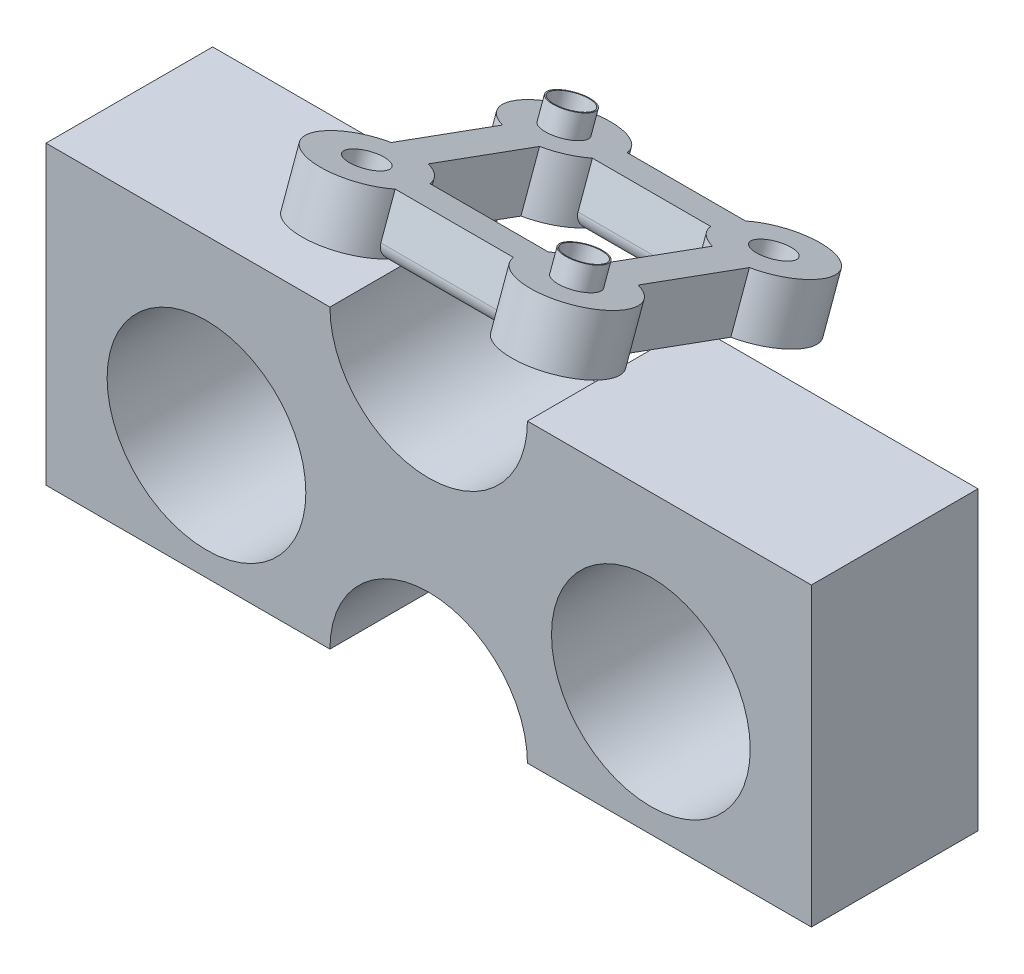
ISO-10303-21;
HEADER;
FILE_DESCRIPTION(('STEP AP214'),'2;1');
FILE_NAME('part.step','',(''),(''),'','','');
FILE_SCHEMA(('AUTOMOTIVE_DESIGN { 1 0 10303 214 1 1 1 1 }'));
ENDSEC;
DATA;
#1=APPLICATION_CONTEXT('core data for automotive mechanical design processes');
#2=APPLICATION_PROTOCOL_DEFINITION('international standard','automotive_design',2000,#1);
#3=PRODUCT_CONTEXT('',#1,'mechanical');
#4=PRODUCT('Part','Part','',(#3));
#5=PRODUCT_RELATED_PRODUCT_CATEGORY('part','',(#4));
#6=PRODUCT_DEFINITION_FORMATION('','',#4);
#7=PRODUCT_DEFINITION_CONTEXT('part definition',#1,'design');
#8=PRODUCT_DEFINITION('design','',#6,#7);
#9=PRODUCT_DEFINITION_SHAPE('','',#8);
#10=(LENGTH_UNIT() NAMED_UNIT(*) SI_UNIT(.MILLI.,.METRE.));
#11=(NAMED_UNIT(*) PLANE_ANGLE_UNIT() SI_UNIT($,.RADIAN.));
#12=(NAMED_UNIT(*) SI_UNIT($,.STERADIAN.) SOLID_ANGLE_UNIT());
#13=UNCERTAINTY_MEASURE_WITH_UNIT(LENGTH_MEASURE(1.E-05),#10,'distance_accuracy_value','');
#14=(GEOMETRIC_REPRESENTATION_CONTEXT(3) GLOBAL_UNCERTAINTY_ASSIGNED_CONTEXT((#13)) GLOBAL_UNIT_ASSIGNED_CONTEXT((#10,
#11,#12)) REPRESENTATION_CONTEXT('',''));
#15=CARTESIAN_POINT('',(0.,0.,0.));
#16=DIRECTION('',(0.,0.,1.));
#17=DIRECTION('',(1.,0.,0.));
#18=AXIS2_PLACEMENT_3D('',#15,#16,#17);
#19=CARTESIAN_POINT('',(39.5,40.6049719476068,6.99812295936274));
#20=DIRECTION('',(0.,-0.939692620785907,0.342020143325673));
#21=DIRECTION('',(0.,-0.342020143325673,-0.939692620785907));
#22=AXIS2_PLACEMENT_3D('',#19,#20,#21);
#23=CYLINDRICAL_SURFACE('',#22,1.5);
#24=CARTESIAN_POINT('',(39.5,33.9706757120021,9.41280931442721));
#25=DIRECTION('',(0.,0.939692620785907,-0.342020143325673));
#26=DIRECTION('',(0.,0.342020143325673,0.939692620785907));
#27=AXIS2_PLACEMENT_3D('',#24,#25,#26);
#28=CIRCLE('',#27,1.5);
#29=CARTESIAN_POINT('',(39.5,34.4837059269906,10.8223482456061));
#30=VERTEX_POINT('',#29);
#31=EDGE_CURVE('E556',#30,#30,#28,.F.);
#32=ORIENTED_EDGE('',*,*,#31,.F.);
#33=EDGE_LOOP('',(#32));
#34=FACE_BOUND('',#33,.T.);
#35=CARTESIAN_POINT('',(39.5,30.2588898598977,10.7637888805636));
#36=DIRECTION('',(0.,-0.939692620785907,0.342020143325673));
#37=DIRECTION('',(0.,-0.342020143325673,-0.939692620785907));
#38=AXIS2_PLACEMENT_3D('',#35,#36,#37);
#39=CIRCLE('',#38,1.5);
#40=CARTESIAN_POINT('',(39.5,29.7458596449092,9.35424994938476));
#41=VERTEX_POINT('',#40);
#42=EDGE_CURVE('E525',#41,#41,#39,.F.);
#43=ORIENTED_EDGE('',*,*,#42,.F.);
#44=EDGE_LOOP('',(#43));
#45=FACE_BOUND('',#44,.T.);
#46=ADVANCED_FACE('F60',(#34,#45),#23,.F.);
#47=CARTESIAN_POINT('',(22.5,34.7906295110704,-8.97665159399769));
#48=DIRECTION('',(0.,-0.939692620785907,0.342020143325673));
#49=DIRECTION('',(0.,-0.342020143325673,-0.939692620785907));
#50=AXIS2_PLACEMENT_3D('',#47,#48,#49);
#51=CYLINDRICAL_SURFACE('',#50,1.5);
#52=CARTESIAN_POINT('',(22.5,28.1563332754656,-6.56196523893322));
#53=DIRECTION('',(0.,0.939692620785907,-0.342020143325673));
#54=DIRECTION('',(0.,0.342020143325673,0.939692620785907));
#55=AXIS2_PLACEMENT_3D('',#52,#53,#54);
#56=CIRCLE('',#55,1.5);
#57=CARTESIAN_POINT('',(22.5,28.6693634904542,-5.15242630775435));
#58=VERTEX_POINT('',#57);
#59=EDGE_CURVE('E552',#58,#58,#56,.F.);
#60=ORIENTED_EDGE('',*,*,#59,.F.);
#61=EDGE_LOOP('',(#60));
#62=FACE_BOUND('',#61,.T.);
#63=CARTESIAN_POINT('',(22.5,24.4445474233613,-5.21098567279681));
#64=DIRECTION('',(0.,-0.939692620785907,0.342020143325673));
#65=DIRECTION('',(0.,-0.342020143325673,-0.939692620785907));
#66=AXIS2_PLACEMENT_3D('',#63,#64,#65);
#67=CIRCLE('',#66,1.5);
#68=CARTESIAN_POINT('',(22.5,23.9315172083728,-6.62052460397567));
#69=VERTEX_POINT('',#68);
#70=EDGE_CURVE('E699',#69,#69,#67,.F.);
#71=ORIENTED_EDGE('',*,*,#70,.F.);
#72=EDGE_LOOP('',(#71));
#73=FACE_BOUND('',#72,.T.);
#74=ADVANCED_FACE('F825',(#62,#73),#51,.F.);
#75=CARTESIAN_POINT('',(39.5,34.7906295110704,-8.97665159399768));
#76=DIRECTION('',(0.,-0.939692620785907,0.342020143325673));
#77=DIRECTION('',(0.,-0.342020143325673,-0.939692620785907));
#78=AXIS2_PLACEMENT_3D('',#75,#76,#77);
#79=CYLINDRICAL_SURFACE('',#78,1.5);
#80=CARTESIAN_POINT('',(39.5,26.5118711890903,-5.96342998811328));
#81=DIRECTION('',(0.,-0.939692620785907,0.342020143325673));
#82=DIRECTION('',(0.,-0.342020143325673,-0.939692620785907));
#83=AXIS2_PLACEMENT_3D('',#80,#81,#82);
#84=CIRCLE('',#83,1.5);
#85=CARTESIAN_POINT('',(39.5,25.9988409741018,-7.37296891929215));
#86=VERTEX_POINT('',#85);
#87=EDGE_CURVE('E559',#86,#86,#84,.F.);
#88=ORIENTED_EDGE('',*,*,#87,.T.);
#89=EDGE_LOOP('',(#88));
#90=FACE_BOUND('',#89,.T.);
#91=CARTESIAN_POINT('',(39.5,24.4445474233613,-5.2109856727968));
#92=DIRECTION('',(0.,-0.939692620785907,0.342020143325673));
#93=DIRECTION('',(0.,-0.342020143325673,-0.939692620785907));
#94=AXIS2_PLACEMENT_3D('',#91,#92,#93);
#95=CIRCLE('',#94,1.5);
#96=CARTESIAN_POINT('',(39.5,23.9315172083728,-6.62052460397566));
#97=VERTEX_POINT('',#96);
#98=EDGE_CURVE('E399',#97,#97,#95,.F.);
#99=ORIENTED_EDGE('',*,*,#98,.F.);
#100=EDGE_LOOP('',(#99));
#101=FACE_BOUND('',#100,.T.);
#102=ADVANCED_FACE('F832',(#90,#101),#79,.F.);
#103=CARTESIAN_POINT('',(22.5,40.6049719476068,6.99812295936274));
#104=DIRECTION('',(0.,-0.939692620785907,0.342020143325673));
#105=DIRECTION('',(0.,-0.342020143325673,-0.939692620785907));
#106=AXIS2_PLACEMENT_3D('',#103,#104,#105);
#107=CYLINDRICAL_SURFACE('',#106,1.5);
#108=CARTESIAN_POINT('',(22.5,32.3262136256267,10.0113445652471));
#109=DIRECTION('',(0.,-0.939692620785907,0.342020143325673));
#110=DIRECTION('',(0.,-0.342020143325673,-0.939692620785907));
#111=AXIS2_PLACEMENT_3D('',#108,#109,#110);
#112=CIRCLE('',#111,1.5);
#113=CARTESIAN_POINT('',(22.5,31.8131834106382,8.60180563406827));
#114=VERTEX_POINT('',#113);
#115=EDGE_CURVE('E555',#114,#114,#112,.F.);
#116=ORIENTED_EDGE('',*,*,#115,.T.);
#117=EDGE_LOOP('',(#116));
#118=FACE_BOUND('',#117,.T.);
#119=CARTESIAN_POINT('',(22.5,30.2588898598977,10.7637888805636));
#120=DIRECTION('',(0.,-0.939692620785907,0.342020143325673));
#121=DIRECTION('',(0.,-0.342020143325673,-0.939692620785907));
#122=AXIS2_PLACEMENT_3D('',#119,#120,#121);
#123=CIRCLE('',#122,1.5);
#124=CARTESIAN_POINT('',(22.5,29.7458596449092,9.35424994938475));
#125=VERTEX_POINT('',#124);
#126=EDGE_CURVE('E541',#125,#125,#123,.F.);
#127=ORIENTED_EDGE('',*,*,#126,.F.);
#128=EDGE_LOOP('',(#127));
#129=FACE_BOUND('',#128,.T.);
#130=ADVANCED_FACE('F841',(#118,#129),#107,.F.);
#131=CARTESIAN_POINT('',(22.5,26.5118711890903,-5.96342998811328));
#132=DIRECTION('',(0.,-0.939692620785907,0.342020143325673));
#133=DIRECTION('',(0.,-0.342020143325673,-0.939692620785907));
#134=AXIS2_PLACEMENT_3D('',#131,#132,#133);
#135=CYLINDRICAL_SURFACE('',#134,4.);
#136=CARTESIAN_POINT('',(22.5,22.3772236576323,-4.45854135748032));
#137=DIRECTION('',(0.,-0.939692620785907,0.342020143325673));
#138=DIRECTION('',(0.,-0.342020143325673,-0.939692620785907));
#139=AXIS2_PLACEMENT_3D('',#136,#137,#138);
#140=CIRCLE('',#139,4.);
#141=CARTESIAN_POINT('',(21.,23.6454682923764,-0.97406786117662));
#142=VERTEX_POINT('',#141);
#143=CARTESIAN_POINT('',(26.4686269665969,22.2062135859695,-4.92838766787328));
#144=VERTEX_POINT('',#143);
#145=EDGE_CURVE('E613',#142,#144,#140,.T.);
#146=ORIENTED_EDGE('',*,*,#145,.F.);
#147=DIRECTION('',(0.,-0.939692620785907,0.342020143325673));
#148=VECTOR('',#147,1.);
#149=CARTESIAN_POINT('',(21.,27.7801158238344,-2.47895649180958));
#150=LINE('',#149,#148);
#151=CARTESIAN_POINT('',(21.,27.7801158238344,-2.47895649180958));
#152=VERTEX_POINT('',#151);
#153=EDGE_CURVE('E671',#152,#142,#150,.T.);
#154=ORIENTED_EDGE('',*,*,#153,.F.);
#155=CARTESIAN_POINT('',(22.5,26.5118711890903,-5.96342998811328));
#156=DIRECTION('',(0.,-0.939692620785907,0.342020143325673));
#157=DIRECTION('',(0.,-0.342020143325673,-0.939692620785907));
#158=AXIS2_PLACEMENT_3D('',#155,#156,#157);
#159=CIRCLE('',#158,4.);
#160=CARTESIAN_POINT('',(26.2080992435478,25.9988409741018,-7.37296891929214));
#161=VERTEX_POINT('',#160);
#162=EDGE_CURVE('E631',#152,#161,#159,.T.);
#163=ORIENTED_EDGE('',*,*,#162,.T.);
#164=DIRECTION('',(0.,-0.939692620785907,0.342020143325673));
#165=VECTOR('',#164,1.);
#166=CARTESIAN_POINT('',(26.2080992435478,25.9988409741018,-7.37296891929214));
#167=LINE('',#166,#165);
#168=CARTESIAN_POINT('',(26.2080992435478,22.8038860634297,-6.21010043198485));
#169=VERTEX_POINT('',#168);
#170=EDGE_CURVE('E656',#161,#169,#167,.T.);
#171=ORIENTED_EDGE('',*,*,#170,.T.);
#172=CARTESIAN_POINT('',(26.2080992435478,22.8038860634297,-6.21010043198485));
#173=CARTESIAN_POINT('',(26.2080970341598,22.7785735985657,-6.2008884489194));
#174=CARTESIAN_POINT('',(26.2085399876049,22.7536472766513,-6.1906560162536));
#175=CARTESIAN_POINT('',(26.2102923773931,22.7047319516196,-6.16823252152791));
#176=CARTESIAN_POINT('',(26.2116015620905,22.6807426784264,-6.15604202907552));
#177=CARTESIAN_POINT('',(26.2167784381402,22.6106049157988,-6.11675922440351));
#178=CARTESIAN_POINT('',(26.2218958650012,22.566069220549,-6.08687606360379));
#179=CARTESIAN_POINT('',(26.2349745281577,22.482641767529,-6.0206874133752));
#180=CARTESIAN_POINT('',(26.2429339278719,22.4437463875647,-5.98438607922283));
#181=CARTESIAN_POINT('',(26.2610055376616,22.3723776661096,-5.90637171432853));
#182=CARTESIAN_POINT('',(26.2711192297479,22.3399087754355,-5.86465496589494));
#183=CARTESIAN_POINT('',(26.29315626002,22.2808623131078,-5.77508088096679));
#184=CARTESIAN_POINT('',(26.3051370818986,22.25458340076,-5.72704110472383));
#185=CARTESIAN_POINT('',(26.3296803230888,22.2102243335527,-5.62744146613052));
#186=CARTESIAN_POINT('',(26.3422429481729,22.1921471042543,-5.5758803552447));
#187=CARTESIAN_POINT('',(26.367747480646,22.163878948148,-5.46766709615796));
#188=CARTESIAN_POINT('',(26.3806746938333,22.1541516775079,-5.41088977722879));
#189=CARTESIAN_POINT('',(26.4053263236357,22.1445905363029,-5.29627242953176));
#190=CARTESIAN_POINT('',(26.4170516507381,22.144749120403,-5.23843324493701));
#191=CARTESIAN_POINT('',(26.4358205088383,22.1537746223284,-5.13801363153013));
#192=CARTESIAN_POINT('',(26.4432955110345,22.1604109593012,-5.09530263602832));
#193=CARTESIAN_POINT('',(26.4569687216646,22.1791937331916,-5.01090394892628));
#194=CARTESIAN_POINT('',(26.4631669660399,22.191340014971,-4.96921622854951));
#195=CARTESIAN_POINT('',(26.4686269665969,22.2062135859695,-4.92838766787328));
#196=B_SPLINE_CURVE_WITH_KNOTS('',3,(#172,#173,#174,#175,#176,#177,#178,#179,#180,#181,#182,
#183,#184,#185,#186,#187,#188,#189,#190,#191,#192,#193,#194,#195),.UNSPECIFIED.,.F.,.F.,(4,2,2,
2,2,2,2,2,2,2,2,4),(0.,0.0807571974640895,0.161490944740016,0.322273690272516,0.482952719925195,
0.643742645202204,0.811172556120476,0.978662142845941,1.1549415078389,1.33108633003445,
1.46232136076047,1.59355269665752),.UNSPECIFIED.);
#197=EDGE_CURVE('E12',#169,#144,#196,.T.);
#198=ORIENTED_EDGE('',*,*,#197,.T.);
#199=EDGE_LOOP('',(#146,#154,#163,#171,#198));
#200=FACE_BOUND('',#199,.T.);
#201=ADVANCED_FACE('F751',(#200),#135,.T.);
#202=CARTESIAN_POINT('',(21.,27.7801158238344,-2.47895649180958));
#203=DIRECTION('',(-1.,0.,0.));
#204=DIRECTION('',(0.,0.,1.));
#205=AXIS2_PLACEMENT_3D('',#202,#203,#204);
#206=PLANE('',#205);
#207=DIRECTION('',(0.,-0.342020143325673,-0.939692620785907));
#208=VECTOR('',#207,1.);
#209=CARTESIAN_POINT('',(21.,23.6454682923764,-0.97406786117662));
#210=LINE('',#209,#208);
#211=CARTESIAN_POINT('',(21.,26.9233214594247,8.0317596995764));
#212=VERTEX_POINT('',#211);
#213=EDGE_CURVE('E635',#212,#142,#210,.T.);
#214=ORIENTED_EDGE('',*,*,#213,.F.);
#215=DIRECTION('',(0.,-0.939692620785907,0.342020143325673));
#216=VECTOR('',#215,1.);
#217=CARTESIAN_POINT('',(21.,31.0579689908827,6.52687106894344));
#218=LINE('',#217,#216);
#219=CARTESIAN_POINT('',(21.,31.0579689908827,6.52687106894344));
#220=VERTEX_POINT('',#219);
#221=EDGE_CURVE('E674',#220,#212,#218,.T.);
#222=ORIENTED_EDGE('',*,*,#221,.F.);
#223=DIRECTION('',(0.,-0.342020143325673,-0.939692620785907));
#224=VECTOR('',#223,1.);
#225=CARTESIAN_POINT('',(21.,27.7801158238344,-2.47895649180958));
#226=LINE('',#225,#224);
#227=EDGE_CURVE('E653',#220,#152,#226,.T.);
#228=ORIENTED_EDGE('',*,*,#227,.T.);
#229=ORIENTED_EDGE('',*,*,#153,.T.);
#230=EDGE_LOOP('',(#214,#222,#228,#229));
#231=FACE_BOUND('',#230,.T.);
#232=ADVANCED_FACE('F887',(#231),#206,.T.);
#233=CARTESIAN_POINT('',(22.5,32.3262136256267,10.0113445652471));
#234=DIRECTION('',(0.,-0.939692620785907,0.342020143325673));
#235=DIRECTION('',(0.,-0.342020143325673,-0.939692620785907));
#236=AXIS2_PLACEMENT_3D('',#233,#234,#235);
#237=CYLINDRICAL_SURFACE('',#236,4.);
#238=CARTESIAN_POINT('',(22.5,28.1915660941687,11.5162331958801));
#239=DIRECTION('',(0.,-0.939692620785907,0.342020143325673));
#240=DIRECTION('',(0.,-0.342020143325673,-0.939692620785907));
#241=AXIS2_PLACEMENT_3D('',#238,#239,#240);
#242=CIRCLE('',#241,4.);
#243=CARTESIAN_POINT('',(26.4686269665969,28.3625761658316,11.9860795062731));
#244=VERTEX_POINT('',#243);
#245=EDGE_CURVE('E666',#244,#212,#242,.T.);
#246=ORIENTED_EDGE('',*,*,#245,.F.);
#247=CARTESIAN_POINT('',(26.4686269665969,28.3625761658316,11.9860795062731));
#248=CARTESIAN_POINT('',(26.4615222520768,28.3819440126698,12.0394204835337));
#249=CARTESIAN_POINT('',(26.4531206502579,28.4058542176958,12.0908740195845));
#250=CARTESIAN_POINT('',(26.4342741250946,28.4617007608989,12.1886536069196));
#251=CARTESIAN_POINT('',(26.4238341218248,28.4936178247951,12.234991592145));
#252=CARTESIAN_POINT('',(26.4014288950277,28.5645005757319,12.3214282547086));
#253=CARTESIAN_POINT('',(26.3894645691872,28.6034621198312,12.3615305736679));
#254=CARTESIAN_POINT('',(26.364749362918,28.6873732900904,12.4346288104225));
#255=CARTESIAN_POINT('',(26.3519980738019,28.7323260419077,12.467620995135));
#256=CARTESIAN_POINT('',(26.3261950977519,28.8284745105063,12.5265503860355));
#257=CARTESIAN_POINT('',(26.3131454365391,28.879813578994,12.5522549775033));
#258=CARTESIAN_POINT('',(26.2881361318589,28.9863768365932,12.5945846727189));
#259=CARTESIAN_POINT('',(26.2761766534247,29.0416016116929,12.6112084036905));
#260=CARTESIAN_POINT('',(26.2544199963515,29.1543818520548,12.6347365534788));
#261=CARTESIAN_POINT('',(26.2446183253,29.2119321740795,12.6416613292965));
#262=CARTESIAN_POINT('',(26.2281314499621,29.3277719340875,12.6454062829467));
#263=CARTESIAN_POINT('',(26.2214417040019,29.3860601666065,12.6422412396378));
#264=CARTESIAN_POINT('',(26.2138533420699,29.4778513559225,12.6291289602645));
#265=CARTESIAN_POINT('',(26.2117054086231,29.5117542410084,12.6224796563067));
#266=CARTESIAN_POINT('',(26.2088247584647,29.5787327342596,12.6057043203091));
#267=CARTESIAN_POINT('',(26.2080913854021,29.6118087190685,12.5955799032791));
#268=CARTESIAN_POINT('',(26.2080992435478,29.6442889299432,12.5837519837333));
#269=B_SPLINE_CURVE_WITH_KNOTS('',3,(#247,#248,#249,#250,#251,#252,#253,#254,#255,#256,#257,
#258,#259,#260,#261,#262,#263,#264,#265,#266,#267,#268),.UNSPECIFIED.,.F.,.F.,(4,2,2,2,2,2,2,2,
2,2,4),(0.,0.171269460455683,0.342130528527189,0.512891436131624,0.683741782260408,
0.859552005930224,1.03538879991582,1.21085597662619,1.38606625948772,1.48971719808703,
1.59332003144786),.UNSPECIFIED.);
#270=CARTESIAN_POINT('',(26.2080992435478,29.6442889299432,12.5837519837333));
#271=VERTEX_POINT('',#270);
#272=EDGE_CURVE('E761',#244,#271,#269,.T.);
#273=ORIENTED_EDGE('',*,*,#272,.T.);
#274=DIRECTION('',(0.,-0.939692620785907,0.342020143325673));
#275=VECTOR('',#274,1.);
#276=CARTESIAN_POINT('',(26.2080992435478,32.8392438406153,11.420883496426));
#277=LINE('',#276,#275);
#278=CARTESIAN_POINT('',(26.2080992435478,32.8392438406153,11.420883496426));
#279=VERTEX_POINT('',#278);
#280=EDGE_CURVE('E676',#279,#271,#277,.T.);
#281=ORIENTED_EDGE('',*,*,#280,.F.);
#282=CARTESIAN_POINT('',(22.5,32.3262136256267,10.0113445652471));
#283=DIRECTION('',(0.,-0.939692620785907,0.342020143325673));
#284=DIRECTION('',(0.,-0.342020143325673,-0.939692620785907));
#285=AXIS2_PLACEMENT_3D('',#282,#283,#284);
#286=CIRCLE('',#285,4.);
#287=EDGE_CURVE('E650',#279,#220,#286,.T.);
#288=ORIENTED_EDGE('',*,*,#287,.T.);
#289=ORIENTED_EDGE('',*,*,#221,.T.);
#290=EDGE_LOOP('',(#246,#273,#281,#288,#289));
#291=FACE_BOUND('',#290,.T.);
#292=ADVANCED_FACE('F890',(#291),#237,.T.);
#293=CARTESIAN_POINT('',(26.2080992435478,32.8392438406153,11.420883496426));
#294=DIRECTION('',(0.,0.342020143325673,0.939692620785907));
#295=DIRECTION('',(0.,-0.939692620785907,0.342020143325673));
#296=AXIS2_PLACEMENT_3D('',#293,#294,#295);
#297=PLANE('',#296);
#298=ORIENTED_EDGE('',*,*,#280,.T.);
#299=DIRECTION('',(-1.,0.,0.));
#300=VECTOR('',#299,1.);
#301=CARTESIAN_POINT('',(26.2080992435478,29.6442889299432,12.5837519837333));
#302=LINE('',#301,#300);
#303=CARTESIAN_POINT('',(35.7919007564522,29.6442889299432,12.5837519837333));
#304=VERTEX_POINT('',#303);
#305=EDGE_CURVE('E718',#271,#304,#302,.F.);
#306=ORIENTED_EDGE('',*,*,#305,.T.);
#307=DIRECTION('',(0.,-0.939692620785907,0.342020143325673));
#308=VECTOR('',#307,1.);
#309=CARTESIAN_POINT('',(35.7919007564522,32.8392438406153,11.420883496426));
#310=LINE('',#309,#308);
#311=CARTESIAN_POINT('',(35.7919007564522,32.8392438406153,11.420883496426));
#312=VERTEX_POINT('',#311);
#313=EDGE_CURVE('E679',#312,#304,#310,.T.);
#314=ORIENTED_EDGE('',*,*,#313,.F.);
#315=DIRECTION('',(-1.,0.,0.));
#316=VECTOR('',#315,1.);
#317=CARTESIAN_POINT('',(26.2080992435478,32.8392438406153,11.420883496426));
#318=LINE('',#317,#316);
#319=EDGE_CURVE('E647',#312,#279,#318,.T.);
#320=ORIENTED_EDGE('',*,*,#319,.T.);
#321=EDGE_LOOP('',(#298,#306,#314,#320));
#322=FACE_BOUND('',#321,.T.);
#323=ADVANCED_FACE('F789',(#322),#297,.T.);
#324=CARTESIAN_POINT('',(39.5,32.3262136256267,10.0113445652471));
#325=DIRECTION('',(0.,-0.939692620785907,0.342020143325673));
#326=DIRECTION('',(0.,-0.342020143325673,-0.939692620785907));
#327=AXIS2_PLACEMENT_3D('',#324,#325,#326);
#328=CYLINDRICAL_SURFACE('',#327,4.);
#329=CARTESIAN_POINT('',(39.5,28.1915660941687,11.5162331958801));
#330=DIRECTION('',(0.,-0.939692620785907,0.342020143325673));
#331=DIRECTION('',(0.,-0.342020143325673,-0.939692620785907));
#332=AXIS2_PLACEMENT_3D('',#329,#330,#331);
#333=CIRCLE('',#332,4.);
#334=CARTESIAN_POINT('',(41.,26.9233214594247,8.0317596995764));
#335=VERTEX_POINT('',#334);
#336=CARTESIAN_POINT('',(35.5313730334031,28.3625761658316,11.9860795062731));
#337=VERTEX_POINT('',#336);
#338=EDGE_CURVE('E664',#335,#337,#333,.T.);
#339=ORIENTED_EDGE('',*,*,#338,.F.);
#340=DIRECTION('',(0.,-0.939692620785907,0.342020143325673));
#341=VECTOR('',#340,1.);
#342=CARTESIAN_POINT('',(41.,31.0579689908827,6.52687106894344));
#343=LINE('',#342,#341);
#344=CARTESIAN_POINT('',(41.,31.0579689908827,6.52687106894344));
#345=VERTEX_POINT('',#344);
#346=EDGE_CURVE('E682',#345,#335,#343,.T.);
#347=ORIENTED_EDGE('',*,*,#346,.F.);
#348=CARTESIAN_POINT('',(39.5,32.3262136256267,10.0113445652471));
#349=DIRECTION('',(0.,-0.939692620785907,0.342020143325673));
#350=DIRECTION('',(0.,-0.342020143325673,-0.939692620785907));
#351=AXIS2_PLACEMENT_3D('',#348,#349,#350);
#352=CIRCLE('',#351,4.);
#353=EDGE_CURVE('E644',#345,#312,#352,.T.);
#354=ORIENTED_EDGE('',*,*,#353,.T.);
#355=ORIENTED_EDGE('',*,*,#313,.T.);
#356=CARTESIAN_POINT('',(35.7919007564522,29.6442889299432,12.5837519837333));
#357=CARTESIAN_POINT('',(35.7919029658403,29.6189771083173,12.5929657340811));
#358=CARTESIAN_POINT('',(35.7914600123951,29.5933051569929,12.6011495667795));
#359=CARTESIAN_POINT('',(35.7897076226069,29.5414202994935,12.6154143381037));
#360=CARTESIAN_POINT('',(35.7883984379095,29.515207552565,12.6214958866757));
#361=CARTESIAN_POINT('',(35.7832215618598,29.4362284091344,12.6364871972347));
#362=CARTESIAN_POINT('',(35.7781041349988,29.3829035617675,12.6422223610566));
#363=CARTESIAN_POINT('',(35.7650254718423,29.2764491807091,12.6451450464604));
#364=CARTESIAN_POINT('',(35.7570660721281,29.2233195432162,12.6423380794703));
#365=CARTESIAN_POINT('',(35.7389944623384,29.1185012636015,12.6284505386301));
#366=CARTESIAN_POINT('',(35.7288807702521,29.0668136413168,12.6173642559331));
#367=CARTESIAN_POINT('',(35.70684373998,28.964004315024,12.5867008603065));
#368=CARTESIAN_POINT('',(35.6948629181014,28.9129941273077,12.5667920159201));
#369=CARTESIAN_POINT('',(35.6703196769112,28.8149916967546,12.5190077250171));
#370=CARTESIAN_POINT('',(35.6577570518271,28.7680008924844,12.4911294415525));
#371=CARTESIAN_POINT('',(35.632252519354,28.6767880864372,12.4264036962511));
#372=CARTESIAN_POINT('',(35.6193253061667,28.6328408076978,12.3891623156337));
#373=CARTESIAN_POINT('',(35.5946736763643,28.551841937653,12.3075061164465));
#374=CARTESIAN_POINT('',(35.5829483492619,28.5147851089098,12.2630967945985));
#375=CARTESIAN_POINT('',(35.5641794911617,28.4571505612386,12.1803694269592));
#376=CARTESIAN_POINT('',(35.5567044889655,28.4347801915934,12.1433851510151));
#377=CARTESIAN_POINT('',(35.5430312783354,28.3949182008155,12.0666586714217));
#378=CARTESIAN_POINT('',(35.5368330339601,28.3774264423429,12.0269165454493));
#379=CARTESIAN_POINT('',(35.5313730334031,28.3625761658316,11.9860795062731));
#380=B_SPLINE_CURVE_WITH_KNOTS('',3,(#356,#357,#358,#359,#360,#361,#362,#363,#364,#365,#366,
#367,#368,#369,#370,#371,#372,#373,#374,#375,#376,#377,#378,#379),.UNSPECIFIED.,.F.,.F.,(4,2,2,
2,2,2,2,2,2,2,2,4),(0.,0.0807571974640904,0.161490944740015,0.322273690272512,0.482952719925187,
0.643742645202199,0.811172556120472,0.978662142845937,1.15494150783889,1.33108633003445,
1.46232136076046,1.59355269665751),.UNSPECIFIED.);
#381=EDGE_CURVE('E768',#304,#337,#380,.T.);
#382=ORIENTED_EDGE('',*,*,#381,.T.);
#383=EDGE_LOOP('',(#339,#347,#354,#355,#382));
#384=FACE_BOUND('',#383,.T.);
#385=ADVANCED_FACE('F783',(#384),#328,.T.);
#386=CARTESIAN_POINT('',(41.,27.7801158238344,-2.47895649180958));
#387=DIRECTION('',(1.,0.,0.));
#388=DIRECTION('',(0.,0.,-1.));
#389=AXIS2_PLACEMENT_3D('',#386,#387,#388);
#390=PLANE('',#389);
#391=DIRECTION('',(0.,0.342020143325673,0.939692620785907));
#392=VECTOR('',#391,1.);
#393=CARTESIAN_POINT('',(41.,23.6454682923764,-0.974067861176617));
#394=LINE('',#393,#392);
#395=CARTESIAN_POINT('',(41.,23.6454682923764,-0.974067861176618));
#396=VERTEX_POINT('',#395);
#397=EDGE_CURVE('E661',#396,#335,#394,.T.);
#398=ORIENTED_EDGE('',*,*,#397,.F.);
#399=DIRECTION('',(0.,-0.939692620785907,0.342020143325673));
#400=VECTOR('',#399,1.);
#401=CARTESIAN_POINT('',(41.,27.7801158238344,-2.47895649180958));
#402=LINE('',#401,#400);
#403=CARTESIAN_POINT('',(41.,27.7801158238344,-2.47895649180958));
#404=VERTEX_POINT('',#403);
#405=EDGE_CURVE('E684',#404,#396,#402,.T.);
#406=ORIENTED_EDGE('',*,*,#405,.F.);
#407=DIRECTION('',(0.,0.342020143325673,0.939692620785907));
#408=VECTOR('',#407,1.);
#409=CARTESIAN_POINT('',(41.,27.7801158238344,-2.47895649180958));
#410=LINE('',#409,#408);
#411=EDGE_CURVE('E641',#404,#345,#410,.T.);
#412=ORIENTED_EDGE('',*,*,#411,.T.);
#413=ORIENTED_EDGE('',*,*,#346,.T.);
#414=EDGE_LOOP('',(#398,#406,#412,#413));
#415=FACE_BOUND('',#414,.T.);
#416=ADVANCED_FACE('F788',(#415),#390,.T.);
#417=CARTESIAN_POINT('',(39.5,26.5118711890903,-5.96342998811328));
#418=DIRECTION('',(0.,-0.939692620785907,0.342020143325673));
#419=DIRECTION('',(0.,-0.342020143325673,-0.939692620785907));
#420=AXIS2_PLACEMENT_3D('',#417,#418,#419);
#421=CYLINDRICAL_SURFACE('',#420,4.);
#422=CARTESIAN_POINT('',(39.5,22.3772236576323,-4.45854135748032));
#423=DIRECTION('',(0.,-0.939692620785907,0.342020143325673));
#424=DIRECTION('',(0.,-0.342020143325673,-0.939692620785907));
#425=AXIS2_PLACEMENT_3D('',#422,#423,#424);
#426=CIRCLE('',#425,4.);
#427=CARTESIAN_POINT('',(35.5313730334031,22.2062135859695,-4.92838766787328));
#428=VERTEX_POINT('',#427);
#429=EDGE_CURVE('E658',#428,#396,#426,.T.);
#430=ORIENTED_EDGE('',*,*,#429,.F.);
#431=CARTESIAN_POINT('',(35.5313730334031,22.2062135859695,-4.92838766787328));
#432=CARTESIAN_POINT('',(35.5384777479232,22.1867632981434,-4.98169863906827));
#433=CARTESIAN_POINT('',(35.5468793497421,22.1720058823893,-5.03648351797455));
#434=CARTESIAN_POINT('',(35.5657258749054,22.1519353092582,-5.1472844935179));
#435=CARTESIAN_POINT('',(35.5761658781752,22.1465997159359,-5.20329734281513));
#436=CARTESIAN_POINT('',(35.5985711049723,22.1453386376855,-5.31507422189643));
#437=CARTESIAN_POINT('',(35.6105354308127,22.1494076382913,-5.37083837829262));
#438=CARTESIAN_POINT('',(35.635250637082,22.1667006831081,-5.48077193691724));
#439=CARTESIAN_POINT('',(35.6480019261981,22.179929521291,-5.53494048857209));
#440=CARTESIAN_POINT('',(35.6738049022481,22.2157044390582,-5.64188606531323));
#441=CARTESIAN_POINT('',(35.6868545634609,22.2385098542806,-5.69457704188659));
#442=CARTESIAN_POINT('',(35.7118638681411,22.2929330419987,-5.79550101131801));
#443=CARTESIAN_POINT('',(35.7238233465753,22.324552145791,-5.84373332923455));
#444=CARTESIAN_POINT('',(35.7455800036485,22.3958232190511,-5.93425067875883));
#445=CARTESIAN_POINT('',(35.7553816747,22.4354581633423,-5.9765479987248));
#446=CARTESIAN_POINT('',(35.7718685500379,22.5217893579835,-6.05387716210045));
#447=CARTESIAN_POINT('',(35.7785582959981,22.5684751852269,-6.08891955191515));
#448=CARTESIAN_POINT('',(35.7861466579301,22.6472197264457,-6.13787720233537));
#449=CARTESIAN_POINT('',(35.7882945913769,22.6774649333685,-6.15457589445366));
#450=CARTESIAN_POINT('',(35.7911752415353,22.7395564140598,-6.18477818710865));
#451=CARTESIAN_POINT('',(35.7919086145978,22.7714019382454,-6.19828326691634));
#452=CARTESIAN_POINT('',(35.7919007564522,22.8038860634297,-6.21010043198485));
#453=B_SPLINE_CURVE_WITH_KNOTS('',3,(#431,#432,#433,#434,#435,#436,#437,#438,#439,#440,#441,
#442,#443,#444,#445,#446,#447,#448,#449,#450,#451,#452),.UNSPECIFIED.,.F.,.F.,(4,2,2,2,2,2,2,2,
2,2,4),(0.,0.171269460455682,0.342130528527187,0.512891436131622,0.683741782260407,
0.859552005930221,1.03538879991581,1.21085597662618,1.38606625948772,1.48971719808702,
1.59332003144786),.UNSPECIFIED.);
#454=CARTESIAN_POINT('',(35.7919007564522,22.8038860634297,-6.21010043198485));
#455=VERTEX_POINT('',#454);
#456=EDGE_CURVE('E74',#428,#455,#453,.T.);
#457=ORIENTED_EDGE('',*,*,#456,.T.);
#458=DIRECTION('',(0.,-0.939692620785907,0.342020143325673));
#459=VECTOR('',#458,1.);
#460=CARTESIAN_POINT('',(35.7919007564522,25.9988409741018,-7.37296891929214));
#461=LINE('',#460,#459);
#462=CARTESIAN_POINT('',(35.7919007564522,25.9988409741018,-7.37296891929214));
#463=VERTEX_POINT('',#462);
#464=EDGE_CURVE('E686',#463,#455,#461,.T.);
#465=ORIENTED_EDGE('',*,*,#464,.F.);
#466=CARTESIAN_POINT('',(39.5,26.5118711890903,-5.96342998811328));
#467=DIRECTION('',(0.,-0.939692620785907,0.342020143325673));
#468=DIRECTION('',(0.,-0.342020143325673,-0.939692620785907));
#469=AXIS2_PLACEMENT_3D('',#466,#467,#468);
#470=CIRCLE('',#469,4.);
#471=EDGE_CURVE('E638',#463,#404,#470,.T.);
#472=ORIENTED_EDGE('',*,*,#471,.T.);
#473=ORIENTED_EDGE('',*,*,#405,.T.);
#474=EDGE_LOOP('',(#430,#457,#465,#472,#473));
#475=FACE_BOUND('',#474,.T.);
#476=ADVANCED_FACE('F793',(#475),#421,.T.);
#477=CARTESIAN_POINT('',(26.2080992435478,25.9988409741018,-7.37296891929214));
#478=DIRECTION('',(0.,-0.342020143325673,-0.939692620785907));
#479=DIRECTION('',(0.,0.939692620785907,-0.342020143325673));
#480=AXIS2_PLACEMENT_3D('',#477,#478,#479);
#481=PLANE('',#480);
#482=ORIENTED_EDGE('',*,*,#464,.T.);
#483=DIRECTION('',(1.,0.,0.));
#484=VECTOR('',#483,1.);
#485=CARTESIAN_POINT('',(26.2080992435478,22.8038860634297,-6.21010043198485));
#486=LINE('',#485,#484);
#487=EDGE_CURVE('E87',#455,#169,#486,.F.);
#488=ORIENTED_EDGE('',*,*,#487,.T.);
#489=ORIENTED_EDGE('',*,*,#170,.F.);
#490=DIRECTION('',(1.,0.,0.));
#491=VECTOR('',#490,1.);
#492=CARTESIAN_POINT('',(26.2080992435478,25.9988409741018,-7.37296891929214));
#493=LINE('',#492,#491);
#494=EDGE_CURVE('E634',#161,#463,#493,.T.);
#495=ORIENTED_EDGE('',*,*,#494,.T.);
#496=EDGE_LOOP('',(#482,#488,#489,#495));
#497=FACE_BOUND('',#496,.T.);
#498=ADVANCED_FACE('F797',(#497),#481,.T.);
#499=CARTESIAN_POINT('',(22.5,26.5118711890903,-5.96342998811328));
#500=DIRECTION('',(0.,-0.939692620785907,0.342020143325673));
#501=DIRECTION('',(0.,-0.342020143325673,-0.939692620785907));
#502=AXIS2_PLACEMENT_3D('',#499,#500,#501);
#503=PLANE('',#502);
#504=ORIENTED_EDGE('',*,*,#87,.F.);
#505=EDGE_LOOP('',(#504));
#506=FACE_BOUND('',#505,.T.);
#507=ORIENTED_EDGE('',*,*,#115,.F.);
#508=EDGE_LOOP('',(#507));
#509=FACE_BOUND('',#508,.T.);
#510=CARTESIAN_POINT('',(39.5,32.3262136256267,10.0113445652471));
#511=DIRECTION('',(0.,-0.939692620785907,0.342020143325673));
#512=DIRECTION('',(0.,-0.342020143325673,-0.939692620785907));
#513=AXIS2_PLACEMENT_3D('',#510,#511,#512);
#514=CIRCLE('',#513,1.6);
#515=CARTESIAN_POINT('',(39.5,31.7789813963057,8.50783637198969));
#516=VERTEX_POINT('',#515);
#517=EDGE_CURVE('E691',#516,#516,#514,.F.);
#518=ORIENTED_EDGE('',*,*,#517,.F.);
#519=EDGE_LOOP('',(#518));
#520=FACE_BOUND('',#519,.T.);
#521=CARTESIAN_POINT('',(22.5,26.5118711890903,-5.96342998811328));
#522=DIRECTION('',(0.,-0.939692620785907,0.342020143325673));
#523=DIRECTION('',(0.,-0.342020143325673,-0.939692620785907));
#524=AXIS2_PLACEMENT_3D('',#521,#522,#523);
#525=CIRCLE('',#524,1.6);
#526=CARTESIAN_POINT('',(22.5,25.9646389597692,-7.46693818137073));
#527=VERTEX_POINT('',#526);
#528=EDGE_CURVE('E673',#527,#527,#525,.F.);
#529=ORIENTED_EDGE('',*,*,#528,.F.);
#530=EDGE_LOOP('',(#529));
#531=FACE_BOUND('',#530,.T.);
#532=DIRECTION('',(1.,0.,0.));
#533=VECTOR('',#532,1.);
#534=CARTESIAN_POINT('',(26.2080992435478,27.0249014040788,-4.55389105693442));
#535=LINE('',#534,#533);
#536=CARTESIAN_POINT('',(26.2080992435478,27.0249014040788,-4.55389105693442));
#537=VERTEX_POINT('',#536);
#538=CARTESIAN_POINT('',(35.7919007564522,27.0249014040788,-4.55389105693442));
#539=VERTEX_POINT('',#538);
#540=EDGE_CURVE('E593',#537,#539,#535,.T.);
#541=ORIENTED_EDGE('',*,*,#540,.T.);
#542=CARTESIAN_POINT('',(39.5,26.5118711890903,-5.96342998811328));
#543=DIRECTION('',(0.,0.939692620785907,-0.342020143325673));
#544=DIRECTION('',(0.,-0.342020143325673,-0.939692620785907));
#545=AXIS2_PLACEMENT_3D('',#542,#543,#544);
#546=CIRCLE('',#545,4.);
#547=CARTESIAN_POINT('',(38.,27.7801158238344,-2.47895649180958));
#548=VERTEX_POINT('',#547);
#549=EDGE_CURVE('E571',#539,#548,#546,.T.);
#550=ORIENTED_EDGE('',*,*,#549,.T.);
#551=DIRECTION('',(0.,0.342020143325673,0.939692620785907));
#552=VECTOR('',#551,1.);
#553=CARTESIAN_POINT('',(38.,27.7801158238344,-2.47895649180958));
#554=LINE('',#553,#552);
#555=CARTESIAN_POINT('',(38.,31.0579689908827,6.52687106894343));
#556=VERTEX_POINT('',#555);
#557=EDGE_CURVE('E574',#548,#556,#554,.T.);
#558=ORIENTED_EDGE('',*,*,#557,.T.);
#559=CARTESIAN_POINT('',(39.5,32.3262136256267,10.0113445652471));
#560=DIRECTION('',(0.,0.939692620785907,-0.342020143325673));
#561=DIRECTION('',(0.,-0.342020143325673,-0.939692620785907));
#562=AXIS2_PLACEMENT_3D('',#559,#560,#561);
#563=CIRCLE('',#562,4.);
#564=CARTESIAN_POINT('',(35.7919007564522,31.8131834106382,8.60180563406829));
#565=VERTEX_POINT('',#564);
#566=EDGE_CURVE('E578',#556,#565,#563,.T.);
#567=ORIENTED_EDGE('',*,*,#566,.T.);
#568=DIRECTION('',(-1.,0.,0.));
#569=VECTOR('',#568,1.);
#570=CARTESIAN_POINT('',(26.2080992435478,31.8131834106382,8.60180563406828));
#571=LINE('',#570,#569);
#572=CARTESIAN_POINT('',(26.2080992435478,31.8131834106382,8.60180563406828));
#573=VERTEX_POINT('',#572);
#574=EDGE_CURVE('E581',#565,#573,#571,.T.);
#575=ORIENTED_EDGE('',*,*,#574,.T.);
#576=CARTESIAN_POINT('',(22.5,32.3262136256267,10.0113445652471));
#577=DIRECTION('',(0.,0.939692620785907,-0.342020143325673));
#578=DIRECTION('',(0.,-0.342020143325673,-0.939692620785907));
#579=AXIS2_PLACEMENT_3D('',#576,#577,#578);
#580=CIRCLE('',#579,4.);
#581=CARTESIAN_POINT('',(24.,31.0579689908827,6.52687106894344));
#582=VERTEX_POINT('',#581);
#583=EDGE_CURVE('E584',#573,#582,#580,.T.);
#584=ORIENTED_EDGE('',*,*,#583,.T.);
#585=DIRECTION('',(0.,-0.342020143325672,-0.939692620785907));
#586=VECTOR('',#585,1.);
#587=CARTESIAN_POINT('',(24.,27.7801158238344,-2.47895649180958));
#588=LINE('',#587,#586);
#589=CARTESIAN_POINT('',(24.,27.7801158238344,-2.47895649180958));
#590=VERTEX_POINT('',#589);
#591=EDGE_CURVE('E587',#582,#590,#588,.T.);
#592=ORIENTED_EDGE('',*,*,#591,.T.);
#593=CARTESIAN_POINT('',(22.5,26.5118711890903,-5.96342998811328));
#594=DIRECTION('',(0.,0.939692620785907,-0.342020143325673));
#595=DIRECTION('',(0.,-0.342020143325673,-0.939692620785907));
#596=AXIS2_PLACEMENT_3D('',#593,#594,#595);
#597=CIRCLE('',#596,4.);
#598=EDGE_CURVE('E590',#590,#537,#597,.T.);
#599=ORIENTED_EDGE('',*,*,#598,.T.);
#600=EDGE_LOOP('',(#541,#550,#558,#567,#575,#584,#592,#599));
#601=FACE_BOUND('',#600,.T.);
#602=ORIENTED_EDGE('',*,*,#162,.F.);
#603=ORIENTED_EDGE('',*,*,#227,.F.);
#604=ORIENTED_EDGE('',*,*,#287,.F.);
#605=ORIENTED_EDGE('',*,*,#319,.F.);
#606=ORIENTED_EDGE('',*,*,#353,.F.);
#607=ORIENTED_EDGE('',*,*,#411,.F.);
#608=ORIENTED_EDGE('',*,*,#471,.F.);
#609=ORIENTED_EDGE('',*,*,#494,.F.);
#610=EDGE_LOOP('',(#602,#603,#604,#605,#606,#607,#608,#609));
#611=FACE_BOUND('',#610,.T.);
#612=ADVANCED_FACE('F871',(#506,#509,#520,#531,#601,#611),#503,.F.);
#613=CARTESIAN_POINT('',(22.5,22.3772236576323,-4.45854135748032));
#614=DIRECTION('',(0.,-0.939692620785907,0.342020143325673));
#615=DIRECTION('',(0.,-0.342020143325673,-0.939692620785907));
#616=AXIS2_PLACEMENT_3D('',#613,#614,#615);
#617=PLANE('',#616);
#618=DIRECTION('',(0.5,0.296198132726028,0.813797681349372));
#619=VECTOR('',#618,1.);
#620=CARTESIAN_POINT('',(24.0877132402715,21.4366682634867,-7.04269606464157));
#621=LINE('',#620,#619);
#622=CARTESIAN_POINT('',(24.0877132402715,21.4366682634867,-7.04269606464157));
#623=VERTEX_POINT('',#622);
#624=CARTESIAN_POINT('',(25.6754264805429,22.3772236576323,-4.45854135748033));
#625=VERTEX_POINT('',#624);
#626=EDGE_CURVE('E353',#623,#625,#621,.T.);
#627=ORIENTED_EDGE('',*,*,#626,.F.);
#628=DIRECTION('',(1.,0.,0.));
#629=VECTOR('',#628,1.);
#630=CARTESIAN_POINT('',(20.9122867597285,21.4366682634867,-7.04269606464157));
#631=LINE('',#630,#629);
#632=CARTESIAN_POINT('',(20.9122867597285,21.4366682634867,-7.04269606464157));
#633=VERTEX_POINT('',#632);
#634=EDGE_CURVE('E372',#633,#623,#631,.T.);
#635=ORIENTED_EDGE('',*,*,#634,.F.);
#636=DIRECTION('',(0.5,-0.296198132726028,-0.813797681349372));
#637=VECTOR('',#636,1.);
#638=CARTESIAN_POINT('',(19.324573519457,22.3772236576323,-4.45854135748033));
#639=LINE('',#638,#637);
#640=CARTESIAN_POINT('',(19.324573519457,22.3772236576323,-4.45854135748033));
#641=VERTEX_POINT('',#640);
#642=EDGE_CURVE('E375',#641,#633,#639,.T.);
#643=ORIENTED_EDGE('',*,*,#642,.F.);
#644=DIRECTION('',(-0.5,-0.296198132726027,-0.813797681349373));
#645=VECTOR('',#644,1.);
#646=CARTESIAN_POINT('',(20.9122867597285,23.3177790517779,-1.87438665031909));
#647=LINE('',#646,#645);
#648=CARTESIAN_POINT('',(20.9122867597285,23.3177790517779,-1.87438665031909));
#649=VERTEX_POINT('',#648);
#650=EDGE_CURVE('E392',#649,#641,#647,.T.);
#651=ORIENTED_EDGE('',*,*,#650,.F.);
#652=DIRECTION('',(-1.,0.,0.));
#653=VECTOR('',#652,1.);
#654=CARTESIAN_POINT('',(24.0877132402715,23.3177790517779,-1.87438665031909));
#655=LINE('',#654,#653);
#656=CARTESIAN_POINT('',(24.0877132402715,23.3177790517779,-1.87438665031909));
#657=VERTEX_POINT('',#656);
#658=EDGE_CURVE('E389',#657,#649,#655,.T.);
#659=ORIENTED_EDGE('',*,*,#658,.F.);
#660=DIRECTION('',(-0.499999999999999,0.296198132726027,0.813797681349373));
#661=VECTOR('',#660,1.);
#662=CARTESIAN_POINT('',(25.6754264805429,22.3772236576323,-4.45854135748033));
#663=LINE('',#662,#661);
#664=EDGE_CURVE('E386',#625,#657,#663,.T.);
#665=ORIENTED_EDGE('',*,*,#664,.F.);
#666=EDGE_LOOP('',(#627,#635,#643,#651,#659,#665));
#667=FACE_BOUND('',#666,.T.);
#668=DIRECTION('',(0.5,0.296198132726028,0.813797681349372));
#669=VECTOR('',#668,1.);
#670=CARTESIAN_POINT('',(41.0877132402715,27.2510107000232,8.93207848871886));
#671=LINE('',#670,#669);
#672=CARTESIAN_POINT('',(41.0877132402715,27.2510107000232,8.93207848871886));
#673=VERTEX_POINT('',#672);
#674=CARTESIAN_POINT('',(42.6754264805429,28.1915660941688,11.5162331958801));
#675=VERTEX_POINT('',#674);
#676=EDGE_CURVE('E427',#673,#675,#671,.T.);
#677=ORIENTED_EDGE('',*,*,#676,.F.);
#678=DIRECTION('',(1.,0.,0.));
#679=VECTOR('',#678,1.);
#680=CARTESIAN_POINT('',(37.9122867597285,27.2510107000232,8.93207848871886));
#681=LINE('',#680,#679);
#682=CARTESIAN_POINT('',(37.9122867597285,27.2510107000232,8.93207848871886));
#683=VERTEX_POINT('',#682);
#684=EDGE_CURVE('E411',#683,#673,#681,.T.);
#685=ORIENTED_EDGE('',*,*,#684,.F.);
#686=DIRECTION('',(0.5,-0.296198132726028,-0.813797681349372));
#687=VECTOR('',#686,1.);
#688=CARTESIAN_POINT('',(36.3245735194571,28.1915660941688,11.5162331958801));
#689=LINE('',#688,#687);
#690=CARTESIAN_POINT('',(36.3245735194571,28.1915660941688,11.5162331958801));
#691=VERTEX_POINT('',#690);
#692=EDGE_CURVE('E439',#691,#683,#689,.T.);
#693=ORIENTED_EDGE('',*,*,#692,.F.);
#694=DIRECTION('',(-0.5,-0.296198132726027,-0.813797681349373));
#695=VECTOR('',#694,1.);
#696=CARTESIAN_POINT('',(37.9122867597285,29.1321214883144,14.1003879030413));
#697=LINE('',#696,#695);
#698=CARTESIAN_POINT('',(37.9122867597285,29.1321214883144,14.1003879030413));
#699=VERTEX_POINT('',#698);
#700=EDGE_CURVE('E436',#699,#691,#697,.T.);
#701=ORIENTED_EDGE('',*,*,#700,.F.);
#702=DIRECTION('',(-1.,0.,0.));
#703=VECTOR('',#702,1.);
#704=CARTESIAN_POINT('',(41.0877132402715,29.1321214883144,14.1003879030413));
#705=LINE('',#704,#703);
#706=CARTESIAN_POINT('',(41.0877132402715,29.1321214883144,14.1003879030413));
#707=VERTEX_POINT('',#706);
#708=EDGE_CURVE('E433',#707,#699,#705,.T.);
#709=ORIENTED_EDGE('',*,*,#708,.F.);
#710=DIRECTION('',(-0.499999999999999,0.296198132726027,0.813797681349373));
#711=VECTOR('',#710,1.);
#712=CARTESIAN_POINT('',(42.6754264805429,28.1915660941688,11.5162331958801));
#713=LINE('',#712,#711);
#714=EDGE_CURVE('E429',#675,#707,#713,.T.);
#715=ORIENTED_EDGE('',*,*,#714,.F.);
#716=EDGE_LOOP('',(#677,#685,#693,#701,#709,#715));
#717=FACE_BOUND('',#716,.T.);
#718=DIRECTION('',(0.5,0.296198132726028,0.813797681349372));
#719=VECTOR('',#718,1.);
#720=CARTESIAN_POINT('',(41.0877132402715,21.4366682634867,-7.04269606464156));
#721=LINE('',#720,#719);
#722=CARTESIAN_POINT('',(41.0877132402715,21.4366682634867,-7.04269606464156));
#723=VERTEX_POINT('',#722);
#724=CARTESIAN_POINT('',(42.6754264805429,22.3772236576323,-4.45854135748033));
#725=VERTEX_POINT('',#724);
#726=EDGE_CURVE('E475',#723,#725,#721,.T.);
#727=ORIENTED_EDGE('',*,*,#726,.F.);
#728=DIRECTION('',(1.,0.,0.));
#729=VECTOR('',#728,1.);
#730=CARTESIAN_POINT('',(37.9122867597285,21.4366682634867,-7.04269606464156));
#731=LINE('',#730,#729);
#732=CARTESIAN_POINT('',(37.9122867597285,21.4366682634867,-7.04269606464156));
#733=VERTEX_POINT('',#732);
#734=EDGE_CURVE('E459',#733,#723,#731,.T.);
#735=ORIENTED_EDGE('',*,*,#734,.F.);
#736=DIRECTION('',(0.5,-0.296198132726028,-0.813797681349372));
#737=VECTOR('',#736,1.);
#738=CARTESIAN_POINT('',(36.324573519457,22.3772236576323,-4.45854135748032));
#739=LINE('',#738,#737);
#740=CARTESIAN_POINT('',(36.324573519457,22.3772236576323,-4.45854135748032));
#741=VERTEX_POINT('',#740);
#742=EDGE_CURVE('E486',#741,#733,#739,.T.);
#743=ORIENTED_EDGE('',*,*,#742,.F.);
#744=DIRECTION('',(-0.5,-0.296198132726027,-0.813797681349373));
#745=VECTOR('',#744,1.);
#746=CARTESIAN_POINT('',(37.9122867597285,23.3177790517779,-1.87438665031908));
#747=LINE('',#746,#745);
#748=CARTESIAN_POINT('',(37.9122867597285,23.3177790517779,-1.87438665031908));
#749=VERTEX_POINT('',#748);
#750=EDGE_CURVE('E483',#749,#741,#747,.T.);
#751=ORIENTED_EDGE('',*,*,#750,.F.);
#752=DIRECTION('',(-1.,0.,0.));
#753=VECTOR('',#752,1.);
#754=CARTESIAN_POINT('',(41.0877132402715,23.3177790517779,-1.87438665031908));
#755=LINE('',#754,#753);
#756=CARTESIAN_POINT('',(41.0877132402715,23.3177790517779,-1.87438665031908));
#757=VERTEX_POINT('',#756);
#758=EDGE_CURVE('E480',#757,#749,#755,.T.);
#759=ORIENTED_EDGE('',*,*,#758,.F.);
#760=DIRECTION('',(-0.499999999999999,0.296198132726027,0.813797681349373));
#761=VECTOR('',#760,1.);
#762=CARTESIAN_POINT('',(42.6754264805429,22.3772236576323,-4.45854135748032));
#763=LINE('',#762,#761);
#764=EDGE_CURVE('E477',#725,#757,#763,.T.);
#765=ORIENTED_EDGE('',*,*,#764,.F.);
#766=EDGE_LOOP('',(#727,#735,#743,#751,#759,#765));
#767=FACE_BOUND('',#766,.T.);
#768=DIRECTION('',(0.5,0.296198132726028,0.813797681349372));
#769=VECTOR('',#768,1.);
#770=CARTESIAN_POINT('',(24.0877132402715,27.2510107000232,8.93207848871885));
#771=LINE('',#770,#769);
#772=CARTESIAN_POINT('',(24.0877132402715,27.2510107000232,8.93207848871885));
#773=VERTEX_POINT('',#772);
#774=CARTESIAN_POINT('',(25.6754264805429,28.1915660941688,11.5162331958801));
#775=VERTEX_POINT('',#774);
#776=EDGE_CURVE('E522',#773,#775,#771,.T.);
#777=ORIENTED_EDGE('',*,*,#776,.F.);
#778=DIRECTION('',(1.,0.,0.));
#779=VECTOR('',#778,1.);
#780=CARTESIAN_POINT('',(20.9122867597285,27.2510107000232,8.93207848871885));
#781=LINE('',#780,#779);
#782=CARTESIAN_POINT('',(20.9122867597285,27.2510107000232,8.93207848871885));
#783=VERTEX_POINT('',#782);
#784=EDGE_CURVE('E506',#783,#773,#781,.T.);
#785=ORIENTED_EDGE('',*,*,#784,.F.);
#786=DIRECTION('',(0.5,-0.296198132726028,-0.813797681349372));
#787=VECTOR('',#786,1.);
#788=CARTESIAN_POINT('',(19.3245735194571,28.1915660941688,11.5162331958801));
#789=LINE('',#788,#787);
#790=CARTESIAN_POINT('',(19.3245735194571,28.1915660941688,11.5162331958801));
#791=VERTEX_POINT('',#790);
#792=EDGE_CURVE('E534',#791,#783,#789,.T.);
#793=ORIENTED_EDGE('',*,*,#792,.F.);
#794=DIRECTION('',(-0.5,-0.296198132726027,-0.813797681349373));
#795=VECTOR('',#794,1.);
#796=CARTESIAN_POINT('',(20.9122867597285,29.1321214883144,14.1003879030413));
#797=LINE('',#796,#795);
#798=CARTESIAN_POINT('',(20.9122867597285,29.1321214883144,14.1003879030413));
#799=VERTEX_POINT('',#798);
#800=EDGE_CURVE('E531',#799,#791,#797,.T.);
#801=ORIENTED_EDGE('',*,*,#800,.F.);
#802=DIRECTION('',(-1.,0.,0.));
#803=VECTOR('',#802,1.);
#804=CARTESIAN_POINT('',(24.0877132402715,29.1321214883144,14.1003879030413));
#805=LINE('',#804,#803);
#806=CARTESIAN_POINT('',(24.0877132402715,29.1321214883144,14.1003879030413));
#807=VERTEX_POINT('',#806);
#808=EDGE_CURVE('E528',#807,#799,#805,.T.);
#809=ORIENTED_EDGE('',*,*,#808,.F.);
#810=DIRECTION('',(-0.499999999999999,0.296198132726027,0.813797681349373));
#811=VECTOR('',#810,1.);
#812=CARTESIAN_POINT('',(25.6754264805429,28.1915660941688,11.5162331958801));
#813=LINE('',#812,#811);
#814=EDGE_CURVE('E524',#775,#807,#813,.T.);
#815=ORIENTED_EDGE('',*,*,#814,.F.);
#816=EDGE_LOOP('',(#777,#785,#793,#801,#809,#815));
#817=FACE_BOUND('',#816,.T.);
#818=CARTESIAN_POINT('',(22.5,28.1915660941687,11.5162331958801));
#819=DIRECTION('',(0.,0.939692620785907,-0.342020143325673));
#820=DIRECTION('',(0.,-0.342020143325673,-0.939692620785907));
#821=AXIS2_PLACEMENT_3D('',#818,#819,#820);
#822=CIRCLE('',#821,4.);
#823=CARTESIAN_POINT('',(26.4686269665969,28.0205560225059,11.0463868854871));
#824=VERTEX_POINT('',#823);
#825=CARTESIAN_POINT('',(24.,26.9233214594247,8.0317596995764));
#826=VERTEX_POINT('',#825);
#827=EDGE_CURVE('E603',#824,#826,#822,.T.);
#828=ORIENTED_EDGE('',*,*,#827,.F.);
#829=DIRECTION('',(-1.,0.,0.));
#830=VECTOR('',#829,1.);
#831=CARTESIAN_POINT('',(35.7919007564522,28.0205560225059,11.0463868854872));
#832=LINE('',#831,#830);
#833=CARTESIAN_POINT('',(35.5313730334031,28.0205560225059,11.0463868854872));
#834=VERTEX_POINT('',#833);
#835=EDGE_CURVE('E715',#824,#834,#832,.F.);
#836=ORIENTED_EDGE('',*,*,#835,.T.);
#837=CARTESIAN_POINT('',(39.5,28.1915660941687,11.5162331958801));
#838=DIRECTION('',(0.,0.939692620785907,-0.342020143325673));
#839=DIRECTION('',(0.,-0.342020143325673,-0.939692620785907));
#840=AXIS2_PLACEMENT_3D('',#837,#838,#839);
#841=CIRCLE('',#840,4.);
#842=CARTESIAN_POINT('',(38.,26.9233214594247,8.0317596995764));
#843=VERTEX_POINT('',#842);
#844=EDGE_CURVE('E601',#843,#834,#841,.T.);
#845=ORIENTED_EDGE('',*,*,#844,.F.);
#846=DIRECTION('',(0.,0.342020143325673,0.939692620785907));
#847=VECTOR('',#846,1.);
#848=CARTESIAN_POINT('',(38.,23.6454682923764,-0.974067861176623));
#849=LINE('',#848,#847);
#850=CARTESIAN_POINT('',(38.,23.6454682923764,-0.974067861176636));
#851=VERTEX_POINT('',#850);
#852=EDGE_CURVE('E598',#851,#843,#849,.T.);
#853=ORIENTED_EDGE('',*,*,#852,.F.);
#854=CARTESIAN_POINT('',(39.5,22.3772236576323,-4.45854135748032));
#855=DIRECTION('',(0.,0.939692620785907,-0.342020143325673));
#856=DIRECTION('',(0.,-0.342020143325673,-0.939692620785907));
#857=AXIS2_PLACEMENT_3D('',#854,#855,#856);
#858=CIRCLE('',#857,4.);
#859=CARTESIAN_POINT('',(35.5313730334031,22.5482337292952,-3.98869504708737));
#860=VERTEX_POINT('',#859);
#861=EDGE_CURVE('E570',#860,#851,#858,.T.);
#862=ORIENTED_EDGE('',*,*,#861,.F.);
#863=DIRECTION('',(1.,0.,0.));
#864=VECTOR('',#863,1.);
#865=CARTESIAN_POINT('',(26.2080992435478,22.5482337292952,-3.98869504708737));
#866=LINE('',#865,#864);
#867=CARTESIAN_POINT('',(26.4686269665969,22.5482337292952,-3.98869504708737));
#868=VERTEX_POINT('',#867);
#869=EDGE_CURVE('E709',#860,#868,#866,.F.);
#870=ORIENTED_EDGE('',*,*,#869,.T.);
#871=CARTESIAN_POINT('',(22.5,22.3772236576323,-4.45854135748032));
#872=DIRECTION('',(0.,0.939692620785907,-0.342020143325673));
#873=DIRECTION('',(0.,-0.342020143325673,-0.939692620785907));
#874=AXIS2_PLACEMENT_3D('',#871,#872,#873);
#875=CIRCLE('',#874,4.);
#876=CARTESIAN_POINT('',(24.,23.6454682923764,-0.974067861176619));
#877=VERTEX_POINT('',#876);
#878=EDGE_CURVE('E575',#877,#868,#875,.T.);
#879=ORIENTED_EDGE('',*,*,#878,.F.);
#880=DIRECTION('',(0.,-0.342020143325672,-0.939692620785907));
#881=VECTOR('',#880,1.);
#882=CARTESIAN_POINT('',(24.,23.6454682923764,-0.974067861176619));
#883=LINE('',#882,#881);
#884=EDGE_CURVE('E606',#826,#877,#883,.T.);
#885=ORIENTED_EDGE('',*,*,#884,.F.);
#886=EDGE_LOOP('',(#828,#836,#845,#853,#862,#870,#879,#885));
#887=FACE_BOUND('',#886,.T.);
#888=DIRECTION('',(-1.,0.,0.));
#889=VECTOR('',#888,1.);
#890=CARTESIAN_POINT('',(22.5,28.3625761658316,11.9860795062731));
#891=LINE('',#890,#889);
#892=EDGE_CURVE('E712',#337,#244,#891,.T.);
#893=ORIENTED_EDGE('',*,*,#892,.T.);
#894=ORIENTED_EDGE('',*,*,#245,.T.);
#895=ORIENTED_EDGE('',*,*,#213,.T.);
#896=ORIENTED_EDGE('',*,*,#145,.T.);
#897=DIRECTION('',(1.,0.,0.));
#898=VECTOR('',#897,1.);
#899=CARTESIAN_POINT('',(22.5,22.2062135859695,-4.92838766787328));
#900=LINE('',#899,#898);
#901=EDGE_CURVE('E706',#144,#428,#900,.T.);
#902=ORIENTED_EDGE('',*,*,#901,.T.);
#903=ORIENTED_EDGE('',*,*,#429,.T.);
#904=ORIENTED_EDGE('',*,*,#397,.T.);
#905=ORIENTED_EDGE('',*,*,#338,.T.);
#906=EDGE_LOOP('',(#893,#894,#895,#896,#902,#903,#904,#905));
#907=FACE_BOUND('',#906,.T.);
#908=ADVANCED_FACE('F874',(#667,#717,#767,#817,#887,#907),#617,.T.);
#909=CARTESIAN_POINT('',(39.5,26.5118711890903,-5.96342998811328));
#910=DIRECTION('',(0.,-0.939692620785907,0.342020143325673));
#911=DIRECTION('',(0.,-0.342020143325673,-0.939692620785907));
#912=AXIS2_PLACEMENT_3D('',#909,#910,#911);
#913=CYLINDRICAL_SURFACE('',#912,4.);
#914=ORIENTED_EDGE('',*,*,#861,.T.);
#915=DIRECTION('',(0.,-0.939692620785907,0.342020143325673));
#916=VECTOR('',#915,1.);
#917=CARTESIAN_POINT('',(38.,27.7801158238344,-2.47895649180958));
#918=LINE('',#917,#916);
#919=EDGE_CURVE('E596',#548,#851,#918,.T.);
#920=ORIENTED_EDGE('',*,*,#919,.F.);
#921=ORIENTED_EDGE('',*,*,#549,.F.);
#922=DIRECTION('',(0.,-0.939692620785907,0.342020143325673));
#923=VECTOR('',#922,1.);
#924=CARTESIAN_POINT('',(35.7919007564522,27.0249014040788,-4.55389105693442));
#925=LINE('',#924,#923);
#926=CARTESIAN_POINT('',(35.7919007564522,23.8299464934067,-3.39102256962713));
#927=VERTEX_POINT('',#926);
#928=EDGE_CURVE('E610',#539,#927,#925,.T.);
#929=ORIENTED_EDGE('',*,*,#928,.T.);
#930=CARTESIAN_POINT('',(35.7919007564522,23.8299464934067,-3.39102256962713));
#931=CARTESIAN_POINT('',(35.7919029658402,23.8046346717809,-3.38180881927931));
#932=CARTESIAN_POINT('',(35.7914600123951,23.7789627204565,-3.37362498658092));
#933=CARTESIAN_POINT('',(35.7897076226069,23.727077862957,-3.35936021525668));
#934=CARTESIAN_POINT('',(35.7883984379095,23.7008651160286,-3.35327866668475));
#935=CARTESIAN_POINT('',(35.7832215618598,23.621885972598,-3.33828735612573));
#936=CARTESIAN_POINT('',(35.7781041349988,23.568561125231,-3.33255219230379));
#937=CARTESIAN_POINT('',(35.7650254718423,23.4621067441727,-3.32962950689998));
#938=CARTESIAN_POINT('',(35.7570660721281,23.4089771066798,-3.33243647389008));
#939=CARTESIAN_POINT('',(35.7389944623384,23.304158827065,-3.34632401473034));
#940=CARTESIAN_POINT('',(35.7288807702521,23.2524712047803,-3.35741029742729));
#941=CARTESIAN_POINT('',(35.70684373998,23.1496618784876,-3.3880736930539));
#942=CARTESIAN_POINT('',(35.6948629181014,23.0986516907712,-3.4079825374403));
#943=CARTESIAN_POINT('',(35.6703196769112,23.0006492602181,-3.45576682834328));
#944=CARTESIAN_POINT('',(35.6577570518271,22.953658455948,-3.4836451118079));
#945=CARTESIAN_POINT('',(35.632252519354,22.8624456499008,-3.5483708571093));
#946=CARTESIAN_POINT('',(35.6193253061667,22.8184983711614,-3.58561223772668));
#947=CARTESIAN_POINT('',(35.5946736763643,22.7374995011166,-3.66726843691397));
#948=CARTESIAN_POINT('',(35.5829483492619,22.7004426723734,-3.71167775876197));
#949=CARTESIAN_POINT('',(35.5641794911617,22.6428081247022,-3.79440512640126));
#950=CARTESIAN_POINT('',(35.5567044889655,22.6204377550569,-3.83138940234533));
#951=CARTESIAN_POINT('',(35.5430312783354,22.580575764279,-3.90811588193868));
#952=CARTESIAN_POINT('',(35.5368330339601,22.5630840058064,-3.94785800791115));
#953=CARTESIAN_POINT('',(35.5313730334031,22.5482337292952,-3.98869504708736));
#954=B_SPLINE_CURVE_WITH_KNOTS('',3,(#930,#931,#932,#933,#934,#935,#936,#937,#938,#939,#940,
#941,#942,#943,#944,#945,#946,#947,#948,#949,#950,#951,#952,#953),.UNSPECIFIED.,.F.,.F.,(4,2,2,
2,2,2,2,2,2,2,2,4),(0.,0.0807571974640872,0.161490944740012,0.322273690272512,0.482952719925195,
0.643742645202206,0.811172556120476,0.97866214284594,1.1549415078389,1.33108633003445,
1.46232136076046,1.59355269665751),.UNSPECIFIED.);
#955=EDGE_CURVE('E776',#927,#860,#954,.T.);
#956=ORIENTED_EDGE('',*,*,#955,.T.);
#957=EDGE_LOOP('',(#914,#920,#921,#929,#956));
#958=FACE_BOUND('',#957,.T.);
#959=ADVANCED_FACE('F926',(#958),#913,.T.);
#960=CARTESIAN_POINT('',(26.2080992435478,27.0249014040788,-4.55389105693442));
#961=DIRECTION('',(0.,-0.342020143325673,-0.939692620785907));
#962=DIRECTION('',(0.,0.939692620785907,-0.342020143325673));
#963=AXIS2_PLACEMENT_3D('',#960,#961,#962);
#964=PLANE('',#963);
#965=DIRECTION('',(0.,-0.939692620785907,0.342020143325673));
#966=VECTOR('',#965,1.);
#967=CARTESIAN_POINT('',(26.2080992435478,27.0249014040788,-4.55389105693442));
#968=LINE('',#967,#966);
#969=CARTESIAN_POINT('',(26.2080992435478,23.8299464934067,-3.39102256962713));
#970=VERTEX_POINT('',#969);
#971=EDGE_CURVE('E614',#537,#970,#968,.T.);
#972=ORIENTED_EDGE('',*,*,#971,.T.);
#973=DIRECTION('',(1.,0.,0.));
#974=VECTOR('',#973,1.);
#975=CARTESIAN_POINT('',(35.7919007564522,23.8299464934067,-3.39102256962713));
#976=LINE('',#975,#974);
#977=EDGE_CURVE('E720',#970,#927,#976,.T.);
#978=ORIENTED_EDGE('',*,*,#977,.T.);
#979=ORIENTED_EDGE('',*,*,#928,.F.);
#980=ORIENTED_EDGE('',*,*,#540,.F.);
#981=EDGE_LOOP('',(#972,#978,#979,#980));
#982=FACE_BOUND('',#981,.T.);
#983=ADVANCED_FACE('F813',(#982),#964,.F.);
#984=CARTESIAN_POINT('',(22.5,26.5118711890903,-5.96342998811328));
#985=DIRECTION('',(0.,-0.939692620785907,0.342020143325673));
#986=DIRECTION('',(0.,-0.342020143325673,-0.939692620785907));
#987=AXIS2_PLACEMENT_3D('',#984,#985,#986);
#988=CYLINDRICAL_SURFACE('',#987,4.);
#989=ORIENTED_EDGE('',*,*,#878,.T.);
#990=CARTESIAN_POINT('',(26.4686269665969,22.5482337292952,-3.98869504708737));
#991=CARTESIAN_POINT('',(26.4615222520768,22.5676015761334,-3.93535406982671));
#992=CARTESIAN_POINT('',(26.4531206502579,22.5915117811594,-3.88390053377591));
#993=CARTESIAN_POINT('',(26.4342741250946,22.6473583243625,-3.78612094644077));
#994=CARTESIAN_POINT('',(26.4238341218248,22.6792753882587,-3.73978296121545));
#995=CARTESIAN_POINT('',(26.4014288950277,22.7501581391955,-3.65334629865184));
#996=CARTESIAN_POINT('',(26.3894645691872,22.7891196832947,-3.61324397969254));
#997=CARTESIAN_POINT('',(26.364749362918,22.8730308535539,-3.54014574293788));
#998=CARTESIAN_POINT('',(26.3519980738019,22.9179836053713,-3.50715355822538));
#999=CARTESIAN_POINT('',(26.3261950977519,23.0141320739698,-3.44822416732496));
#1000=CARTESIAN_POINT('',(26.3131454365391,23.0654711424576,-3.42251957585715));
#1001=CARTESIAN_POINT('',(26.2881361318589,23.1720344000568,-3.38018988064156));
#1002=CARTESIAN_POINT('',(26.2761766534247,23.2272591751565,-3.3635661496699));
#1003=CARTESIAN_POINT('',(26.2544199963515,23.3400394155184,-3.34003799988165));
#1004=CARTESIAN_POINT('',(26.2446183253,23.3975897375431,-3.33311322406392));
#1005=CARTESIAN_POINT('',(26.2281314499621,23.5134294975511,-3.32936827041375));
#1006=CARTESIAN_POINT('',(26.2214417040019,23.57171773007,-3.33253331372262));
#1007=CARTESIAN_POINT('',(26.2138533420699,23.6635089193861,-3.34564559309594));
#1008=CARTESIAN_POINT('',(26.2117054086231,23.6974118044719,-3.35229489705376));
#1009=CARTESIAN_POINT('',(26.2088247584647,23.7643902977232,-3.36907023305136));
#1010=CARTESIAN_POINT('',(26.2080913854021,23.797466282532,-3.3791946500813));
#1011=CARTESIAN_POINT('',(26.2080992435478,23.8299464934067,-3.39102256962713));
#1012=B_SPLINE_CURVE_WITH_KNOTS('',3,(#990,#991,#992,#993,#994,#995,#996,#997,#998,#999,#1000,
#1001,#1002,#1003,#1004,#1005,#1006,#1007,#1008,#1009,#1010,#1011),.UNSPECIFIED.,.F.,.F.,(4,2,2,
2,2,2,2,2,2,2,4),(0.,0.171269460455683,0.342130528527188,0.512891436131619,0.683741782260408,
0.859552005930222,1.03538879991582,1.21085597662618,1.38606625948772,1.48971719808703,
1.59332003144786),.UNSPECIFIED.);
#1013=EDGE_CURVE('E802',#868,#970,#1012,.T.);
#1014=ORIENTED_EDGE('',*,*,#1013,.T.);
#1015=ORIENTED_EDGE('',*,*,#971,.F.);
#1016=ORIENTED_EDGE('',*,*,#598,.F.);
#1017=DIRECTION('',(0.,-0.939692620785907,0.342020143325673));
#1018=VECTOR('',#1017,1.);
#1019=CARTESIAN_POINT('',(24.,27.7801158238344,-2.47895649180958));
#1020=LINE('',#1019,#1018);
#1021=EDGE_CURVE('E617',#590,#877,#1020,.T.);
#1022=ORIENTED_EDGE('',*,*,#1021,.T.);
#1023=EDGE_LOOP('',(#989,#1014,#1015,#1016,#1022));
#1024=FACE_BOUND('',#1023,.T.);
#1025=ADVANCED_FACE('F808',(#1024),#988,.T.);
#1026=CARTESIAN_POINT('',(24.,27.7801158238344,-2.47895649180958));
#1027=DIRECTION('',(-1.,0.,0.));
#1028=DIRECTION('',(0.,0.,1.));
#1029=AXIS2_PLACEMENT_3D('',#1026,#1027,#1028);
#1030=PLANE('',#1029);
#1031=ORIENTED_EDGE('',*,*,#884,.T.);
#1032=ORIENTED_EDGE('',*,*,#1021,.F.);
#1033=ORIENTED_EDGE('',*,*,#591,.F.);
#1034=DIRECTION('',(0.,-0.939692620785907,0.342020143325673));
#1035=VECTOR('',#1034,1.);
#1036=CARTESIAN_POINT('',(24.,31.0579689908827,6.52687106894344));
#1037=LINE('',#1036,#1035);
#1038=EDGE_CURVE('E619',#582,#826,#1037,.T.);
#1039=ORIENTED_EDGE('',*,*,#1038,.T.);
#1040=EDGE_LOOP('',(#1031,#1032,#1033,#1039));
#1041=FACE_BOUND('',#1040,.T.);
#1042=ADVANCED_FACE('F812',(#1041),#1030,.F.);
#1043=CARTESIAN_POINT('',(22.5,32.3262136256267,10.0113445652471));
#1044=DIRECTION('',(0.,-0.939692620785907,0.342020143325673));
#1045=DIRECTION('',(0.,-0.342020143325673,-0.939692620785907));
#1046=AXIS2_PLACEMENT_3D('',#1043,#1044,#1045);
#1047=CYLINDRICAL_SURFACE('',#1046,4.);
#1048=ORIENTED_EDGE('',*,*,#827,.T.);
#1049=ORIENTED_EDGE('',*,*,#1038,.F.);
#1050=ORIENTED_EDGE('',*,*,#583,.F.);
#1051=DIRECTION('',(0.,-0.939692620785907,0.342020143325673));
#1052=VECTOR('',#1051,1.);
#1053=CARTESIAN_POINT('',(26.2080992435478,31.8131834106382,8.60180563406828));
#1054=LINE('',#1053,#1052);
#1055=CARTESIAN_POINT('',(26.2080992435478,28.6182284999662,9.76467412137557));
#1056=VERTEX_POINT('',#1055);
#1057=EDGE_CURVE('E621',#573,#1056,#1054,.T.);
#1058=ORIENTED_EDGE('',*,*,#1057,.T.);
#1059=CARTESIAN_POINT('',(26.2080992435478,28.6182284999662,9.76467412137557));
#1060=CARTESIAN_POINT('',(26.2080970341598,28.5929160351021,9.77388610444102));
#1061=CARTESIAN_POINT('',(26.2085399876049,28.5679897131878,9.78411853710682));
#1062=CARTESIAN_POINT('',(26.2102923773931,28.5190743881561,9.80654203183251));
#1063=CARTESIAN_POINT('',(26.2116015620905,28.4950851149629,9.8187325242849));
#1064=CARTESIAN_POINT('',(26.2167784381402,28.4249473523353,9.85801532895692));
#1065=CARTESIAN_POINT('',(26.2218958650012,28.3804116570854,9.88789848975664));
#1066=CARTESIAN_POINT('',(26.2349745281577,28.2969842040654,9.95408713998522));
#1067=CARTESIAN_POINT('',(26.2429339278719,28.2580888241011,9.99038847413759));
#1068=CARTESIAN_POINT('',(26.2610055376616,28.186720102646,10.0684028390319));
#1069=CARTESIAN_POINT('',(26.2711192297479,28.1542512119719,10.1101195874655));
#1070=CARTESIAN_POINT('',(26.29315626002,28.0952047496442,10.1996936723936));
#1071=CARTESIAN_POINT('',(26.3051370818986,28.0689258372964,10.2477334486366));
#1072=CARTESIAN_POINT('',(26.3296803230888,28.0245667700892,10.3473330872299));
#1073=CARTESIAN_POINT('',(26.3422429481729,28.0064895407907,10.3988941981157));
#1074=CARTESIAN_POINT('',(26.367747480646,27.9782213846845,10.5071074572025));
#1075=CARTESIAN_POINT('',(26.3806746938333,27.9684941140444,10.5638847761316));
#1076=CARTESIAN_POINT('',(26.4053263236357,27.9589329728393,10.6785021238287));
#1077=CARTESIAN_POINT('',(26.4170516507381,27.9590915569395,10.7363413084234));
#1078=CARTESIAN_POINT('',(26.4358205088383,27.9681170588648,10.8367609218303));
#1079=CARTESIAN_POINT('',(26.4432955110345,27.9747533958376,10.8794719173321));
#1080=CARTESIAN_POINT('',(26.4569687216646,27.993536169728,10.9638706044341));
#1081=CARTESIAN_POINT('',(26.4631669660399,28.0056824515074,11.0055583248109));
#1082=CARTESIAN_POINT('',(26.4686269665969,28.0205560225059,11.0463868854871));
#1083=B_SPLINE_CURVE_WITH_KNOTS('',3,(#1059,#1060,#1061,#1062,#1063,#1064,#1065,#1066,#1067,
#1068,#1069,#1070,#1071,#1072,#1073,#1074,#1075,#1076,#1077,#1078,#1079,#1080,#1081,#1082),
.UNSPECIFIED.,.F.,.F.,(4,2,2,2,2,2,2,2,2,2,2,4),(0.,0.080757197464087,0.161490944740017,
0.322273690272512,0.482952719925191,0.643742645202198,0.811172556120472,0.978662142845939,
1.1549415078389,1.33108633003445,1.46232136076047,1.59355269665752),.UNSPECIFIED.);
#1084=EDGE_CURVE('E724',#1056,#824,#1083,.T.);
#1085=ORIENTED_EDGE('',*,*,#1084,.T.);
#1086=EDGE_LOOP('',(#1048,#1049,#1050,#1058,#1085));
#1087=FACE_BOUND('',#1086,.T.);
#1088=ADVANCED_FACE('F740',(#1087),#1047,.T.);
#1089=CARTESIAN_POINT('',(26.2080992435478,31.8131834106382,8.60180563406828));
#1090=DIRECTION('',(0.,0.342020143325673,0.939692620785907));
#1091=DIRECTION('',(0.,-0.939692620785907,0.342020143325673));
#1092=AXIS2_PLACEMENT_3D('',#1089,#1090,#1091);
#1093=PLANE('',#1092);
#1094=DIRECTION('',(0.,-0.939692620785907,0.342020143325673));
#1095=VECTOR('',#1094,1.);
#1096=CARTESIAN_POINT('',(35.7919007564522,31.8131834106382,8.60180563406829));
#1097=LINE('',#1096,#1095);
#1098=CARTESIAN_POINT('',(35.7919007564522,28.6182284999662,9.76467412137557));
#1099=VERTEX_POINT('',#1098);
#1100=EDGE_CURVE('E624',#565,#1099,#1097,.T.);
#1101=ORIENTED_EDGE('',*,*,#1100,.T.);
#1102=DIRECTION('',(-1.,0.,0.));
#1103=VECTOR('',#1102,1.);
#1104=CARTESIAN_POINT('',(26.2080992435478,28.6182284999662,9.76467412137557));
#1105=LINE('',#1104,#1103);
#1106=EDGE_CURVE('E694',#1099,#1056,#1105,.T.);
#1107=ORIENTED_EDGE('',*,*,#1106,.T.);
#1108=ORIENTED_EDGE('',*,*,#1057,.F.);
#1109=ORIENTED_EDGE('',*,*,#574,.F.);
#1110=EDGE_LOOP('',(#1101,#1107,#1108,#1109));
#1111=FACE_BOUND('',#1110,.T.);
#1112=ADVANCED_FACE('F822',(#1111),#1093,.F.);
#1113=CARTESIAN_POINT('',(39.5,32.3262136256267,10.0113445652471));
#1114=DIRECTION('',(0.,-0.939692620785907,0.342020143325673));
#1115=DIRECTION('',(0.,-0.342020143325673,-0.939692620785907));
#1116=AXIS2_PLACEMENT_3D('',#1113,#1114,#1115);
#1117=CYLINDRICAL_SURFACE('',#1116,4.);
#1118=ORIENTED_EDGE('',*,*,#844,.T.);
#1119=CARTESIAN_POINT('',(35.5313730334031,28.0205560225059,11.0463868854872));
#1120=CARTESIAN_POINT('',(35.5384777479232,28.0011057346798,10.9930759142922));
#1121=CARTESIAN_POINT('',(35.5468793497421,27.9863483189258,10.9382910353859));
#1122=CARTESIAN_POINT('',(35.5657258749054,27.9662777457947,10.8274900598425));
#1123=CARTESIAN_POINT('',(35.5761658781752,27.9609421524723,10.7714772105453));
#1124=CARTESIAN_POINT('',(35.5985711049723,27.9596810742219,10.659700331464));
#1125=CARTESIAN_POINT('',(35.6105354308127,27.9637500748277,10.6039361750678));
#1126=CARTESIAN_POINT('',(35.635250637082,27.9810431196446,10.4940026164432));
#1127=CARTESIAN_POINT('',(35.6480019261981,27.9942719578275,10.4398340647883));
#1128=CARTESIAN_POINT('',(35.6738049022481,28.0300468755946,10.3328884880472));
#1129=CARTESIAN_POINT('',(35.6868545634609,28.052852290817,10.2801975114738));
#1130=CARTESIAN_POINT('',(35.7118638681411,28.1072754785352,10.1792735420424));
#1131=CARTESIAN_POINT('',(35.7238233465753,28.1388945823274,10.1310412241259));
#1132=CARTESIAN_POINT('',(35.7455800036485,28.2101656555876,10.0405238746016));
#1133=CARTESIAN_POINT('',(35.7553816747,28.2498005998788,9.99822655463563));
#1134=CARTESIAN_POINT('',(35.7718685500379,28.33613179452,9.92089739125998));
#1135=CARTESIAN_POINT('',(35.7785582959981,28.3828176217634,9.88585500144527));
#1136=CARTESIAN_POINT('',(35.7861466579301,28.4615621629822,9.83689735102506));
#1137=CARTESIAN_POINT('',(35.7882945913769,28.491807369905,9.82019865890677));
#1138=CARTESIAN_POINT('',(35.7911752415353,28.5538988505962,9.78999636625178));
#1139=CARTESIAN_POINT('',(35.7919086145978,28.5857443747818,9.77649128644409));
#1140=CARTESIAN_POINT('',(35.7919007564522,28.6182284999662,9.76467412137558));
#1141=B_SPLINE_CURVE_WITH_KNOTS('',3,(#1119,#1120,#1121,#1122,#1123,#1124,#1125,#1126,#1127,
#1128,#1129,#1130,#1131,#1132,#1133,#1134,#1135,#1136,#1137,#1138,#1139,#1140),.UNSPECIFIED.,
.F.,.F.,(4,2,2,2,2,2,2,2,2,2,4),(0.,0.171269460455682,0.342130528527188,0.512891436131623,
0.683741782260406,0.859552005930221,1.03538879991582,1.21085597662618,1.38606625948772,
1.48971719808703,1.59332003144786),.UNSPECIFIED.);
#1142=EDGE_CURVE('E733',#834,#1099,#1141,.T.);
#1143=ORIENTED_EDGE('',*,*,#1142,.T.);
#1144=ORIENTED_EDGE('',*,*,#1100,.F.);
#1145=ORIENTED_EDGE('',*,*,#566,.F.);
#1146=DIRECTION('',(0.,-0.939692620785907,0.342020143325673));
#1147=VECTOR('',#1146,1.);
#1148=CARTESIAN_POINT('',(38.,31.0579689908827,6.52687106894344));
#1149=LINE('',#1148,#1147);
#1150=EDGE_CURVE('E627',#556,#843,#1149,.T.);
#1151=ORIENTED_EDGE('',*,*,#1150,.T.);
#1152=EDGE_LOOP('',(#1118,#1143,#1144,#1145,#1151));
#1153=FACE_BOUND('',#1152,.T.);
#1154=ADVANCED_FACE('F864',(#1153),#1117,.T.);
#1155=CARTESIAN_POINT('',(38.,27.7801158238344,-2.47895649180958));
#1156=DIRECTION('',(1.,0.,0.));
#1157=DIRECTION('',(0.,0.,-1.));
#1158=AXIS2_PLACEMENT_3D('',#1155,#1156,#1157);
#1159=PLANE('',#1158);
#1160=ORIENTED_EDGE('',*,*,#852,.T.);
#1161=ORIENTED_EDGE('',*,*,#1150,.F.);
#1162=ORIENTED_EDGE('',*,*,#557,.F.);
#1163=ORIENTED_EDGE('',*,*,#919,.T.);
#1164=EDGE_LOOP('',(#1160,#1161,#1162,#1163));
#1165=FACE_BOUND('',#1164,.T.);
#1166=ADVANCED_FACE('F860',(#1165),#1159,.F.);
#1167=CARTESIAN_POINT('',(22.5,28.1563332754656,-6.56196523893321));
#1168=DIRECTION('',(0.,-0.939692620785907,0.342020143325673));
#1169=DIRECTION('',(0.,-0.342020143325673,-0.939692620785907));
#1170=AXIS2_PLACEMENT_3D('',#1167,#1168,#1169);
#1171=CYLINDRICAL_SURFACE('',#1170,1.6);
#1172=CARTESIAN_POINT('',(22.5,28.1563332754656,-6.56196523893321));
#1173=DIRECTION('',(0.,0.939692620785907,-0.342020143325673));
#1174=DIRECTION('',(0.,0.342020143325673,0.939692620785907));
#1175=AXIS2_PLACEMENT_3D('',#1172,#1173,#1174);
#1176=CIRCLE('',#1175,1.6);
#1177=CARTESIAN_POINT('',(22.5,28.7035655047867,-5.05845704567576));
#1178=VERTEX_POINT('',#1177);
#1179=EDGE_CURVE('E567',#1178,#1178,#1176,.T.);
#1180=ORIENTED_EDGE('',*,*,#1179,.F.);
#1181=EDGE_LOOP('',(#1180));
#1182=FACE_BOUND('',#1181,.T.);
#1183=ORIENTED_EDGE('',*,*,#528,.T.);
#1184=EDGE_LOOP('',(#1183));
#1185=FACE_BOUND('',#1184,.T.);
#1186=ADVANCED_FACE('F857',(#1182,#1185),#1171,.T.);
#1187=CARTESIAN_POINT('',(22.5,28.1563332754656,-6.56196523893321));
#1188=DIRECTION('',(0.,0.939692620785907,-0.342020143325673));
#1189=DIRECTION('',(0.,0.342020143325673,0.939692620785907));
#1190=AXIS2_PLACEMENT_3D('',#1187,#1188,#1189);
#1191=PLANE('',#1190);
#1192=ORIENTED_EDGE('',*,*,#59,.T.);
#1193=EDGE_LOOP('',(#1192));
#1194=FACE_BOUND('',#1193,.T.);
#1195=ORIENTED_EDGE('',*,*,#1179,.T.);
#1196=EDGE_LOOP('',(#1195));
#1197=FACE_BOUND('',#1196,.T.);
#1198=ADVANCED_FACE('F854',(#1194,#1197),#1191,.T.);
#1199=CARTESIAN_POINT('',(39.5,33.9706757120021,9.41280931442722));
#1200=DIRECTION('',(0.,-0.939692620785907,0.342020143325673));
#1201=DIRECTION('',(0.,-0.342020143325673,-0.939692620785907));
#1202=AXIS2_PLACEMENT_3D('',#1199,#1200,#1201);
#1203=CYLINDRICAL_SURFACE('',#1202,1.6);
#1204=CARTESIAN_POINT('',(39.5,33.9706757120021,9.41280931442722));
#1205=DIRECTION('',(0.,0.939692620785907,-0.342020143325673));
#1206=DIRECTION('',(0.,0.342020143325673,0.939692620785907));
#1207=AXIS2_PLACEMENT_3D('',#1204,#1205,#1206);
#1208=CIRCLE('',#1207,1.6);
#1209=CARTESIAN_POINT('',(39.5,34.5179079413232,10.9163175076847));
#1210=VERTEX_POINT('',#1209);
#1211=EDGE_CURVE('E564',#1210,#1210,#1208,.T.);
#1212=ORIENTED_EDGE('',*,*,#1211,.F.);
#1213=EDGE_LOOP('',(#1212));
#1214=FACE_BOUND('',#1213,.T.);
#1215=ORIENTED_EDGE('',*,*,#517,.T.);
#1216=EDGE_LOOP('',(#1215));
#1217=FACE_BOUND('',#1216,.T.);
#1218=ADVANCED_FACE('F850',(#1214,#1217),#1203,.T.);
#1219=CARTESIAN_POINT('',(39.5,33.9706757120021,9.41280931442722));
#1220=DIRECTION('',(0.,0.939692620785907,-0.342020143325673));
#1221=DIRECTION('',(0.,0.342020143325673,0.939692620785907));
#1222=AXIS2_PLACEMENT_3D('',#1219,#1220,#1221);
#1223=PLANE('',#1222);
#1224=ORIENTED_EDGE('',*,*,#31,.T.);
#1225=EDGE_LOOP('',(#1224));
#1226=FACE_BOUND('',#1225,.T.);
#1227=ORIENTED_EDGE('',*,*,#1211,.T.);
#1228=EDGE_LOOP('',(#1227));
#1229=FACE_BOUND('',#1228,.T.);
#1230=ADVANCED_FACE('F846',(#1226,#1229),#1223,.T.);
#1231=CARTESIAN_POINT('',(0.,23.2598570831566,-8.46589563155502));
#1232=DIRECTION('',(0.,-0.939692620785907,0.342020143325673));
#1233=DIRECTION('',(0.,-0.342020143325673,-0.939692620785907));
#1234=AXIS2_PLACEMENT_3D('',#1231,#1232,#1233);
#1235=PLANE('',#1234);
#1236=DIRECTION('',(0.5,0.296198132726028,0.813797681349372));
#1237=VECTOR('',#1236,1.);
#1238=CARTESIAN_POINT('',(24.0877132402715,29.3183344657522,8.17963417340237));
#1239=LINE('',#1238,#1237);
#1240=CARTESIAN_POINT('',(24.0877132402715,29.3183344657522,8.17963417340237));
#1241=VERTEX_POINT('',#1240);
#1242=CARTESIAN_POINT('',(25.6754264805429,30.2588898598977,10.7637888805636));
#1243=VERTEX_POINT('',#1242);
#1244=EDGE_CURVE('E502',#1241,#1243,#1239,.T.);
#1245=ORIENTED_EDGE('',*,*,#1244,.T.);
#1246=DIRECTION('',(-0.499999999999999,0.296198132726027,0.813797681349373));
#1247=VECTOR('',#1246,1.);
#1248=CARTESIAN_POINT('',(25.6754264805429,30.2588898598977,10.7637888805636));
#1249=LINE('',#1248,#1247);
#1250=CARTESIAN_POINT('',(24.0877132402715,31.1994452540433,13.3479435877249));
#1251=VERTEX_POINT('',#1250);
#1252=EDGE_CURVE('E505',#1243,#1251,#1249,.T.);
#1253=ORIENTED_EDGE('',*,*,#1252,.T.);
#1254=DIRECTION('',(-1.,0.,0.));
#1255=VECTOR('',#1254,1.);
#1256=CARTESIAN_POINT('',(24.0877132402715,31.1994452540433,13.3479435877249));
#1257=LINE('',#1256,#1255);
#1258=CARTESIAN_POINT('',(20.9122867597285,31.1994452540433,13.3479435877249));
#1259=VERTEX_POINT('',#1258);
#1260=EDGE_CURVE('E509',#1251,#1259,#1257,.T.);
#1261=ORIENTED_EDGE('',*,*,#1260,.T.);
#1262=DIRECTION('',(-0.5,-0.296198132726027,-0.813797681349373));
#1263=VECTOR('',#1262,1.);
#1264=CARTESIAN_POINT('',(20.9122867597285,31.1994452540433,13.3479435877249));
#1265=LINE('',#1264,#1263);
#1266=CARTESIAN_POINT('',(19.3245735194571,30.2588898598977,10.7637888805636));
#1267=VERTEX_POINT('',#1266);
#1268=EDGE_CURVE('E512',#1259,#1267,#1265,.T.);
#1269=ORIENTED_EDGE('',*,*,#1268,.T.);
#1270=DIRECTION('',(0.5,-0.296198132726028,-0.813797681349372));
#1271=VECTOR('',#1270,1.);
#1272=CARTESIAN_POINT('',(19.3245735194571,30.2588898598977,10.7637888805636));
#1273=LINE('',#1272,#1271);
#1274=CARTESIAN_POINT('',(20.9122867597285,29.3183344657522,8.17963417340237));
#1275=VERTEX_POINT('',#1274);
#1276=EDGE_CURVE('E515',#1267,#1275,#1273,.T.);
#1277=ORIENTED_EDGE('',*,*,#1276,.T.);
#1278=DIRECTION('',(1.,0.,0.));
#1279=VECTOR('',#1278,1.);
#1280=CARTESIAN_POINT('',(20.9122867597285,29.3183344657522,8.17963417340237));
#1281=LINE('',#1280,#1279);
#1282=EDGE_CURVE('E518',#1275,#1241,#1281,.T.);
#1283=ORIENTED_EDGE('',*,*,#1282,.T.);
#1284=EDGE_LOOP('',(#1245,#1253,#1261,#1269,#1277,#1283));
#1285=FACE_BOUND('',#1284,.T.);
#1286=ORIENTED_EDGE('',*,*,#126,.T.);
#1287=EDGE_LOOP('',(#1286));
#1288=FACE_BOUND('',#1287,.T.);
#1289=ADVANCED_FACE('F849',(#1285,#1288),#1235,.T.);
#1290=CARTESIAN_POINT('',(24.0877132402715,29.3183344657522,8.17963417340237));
#1291=DIRECTION('',(0.866025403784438,-0.171010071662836,-0.469846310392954));
#1292=DIRECTION('',(-0.476870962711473,0.,-0.878973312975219));
#1293=AXIS2_PLACEMENT_3D('',#1290,#1291,#1292);
#1294=PLANE('',#1293);
#1295=ORIENTED_EDGE('',*,*,#776,.T.);
#1296=DIRECTION('',(0.,-0.939692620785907,0.342020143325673));
#1297=VECTOR('',#1296,1.);
#1298=CARTESIAN_POINT('',(25.6754264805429,30.2588898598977,10.7637888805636));
#1299=LINE('',#1298,#1297);
#1300=EDGE_CURVE('E521',#1243,#775,#1299,.T.);
#1301=ORIENTED_EDGE('',*,*,#1300,.F.);
#1302=ORIENTED_EDGE('',*,*,#1244,.F.);
#1303=DIRECTION('',(0.,-0.939692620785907,0.342020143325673));
#1304=VECTOR('',#1303,1.);
#1305=CARTESIAN_POINT('',(24.0877132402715,29.3183344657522,8.17963417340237));
#1306=LINE('',#1305,#1304);
#1307=EDGE_CURVE('E539',#1241,#773,#1306,.T.);
#1308=ORIENTED_EDGE('',*,*,#1307,.T.);
#1309=EDGE_LOOP('',(#1295,#1301,#1302,#1308));
#1310=FACE_BOUND('',#1309,.T.);
#1311=ADVANCED_FACE('F1055',(#1310),#1294,.F.);
#1312=CARTESIAN_POINT('',(20.9122867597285,29.3183344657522,8.17963417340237));
#1313=DIRECTION('',(0.,-0.342020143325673,-0.939692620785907));
#1314=DIRECTION('',(0.,0.939692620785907,-0.342020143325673));
#1315=AXIS2_PLACEMENT_3D('',#1312,#1313,#1314);
#1316=PLANE('',#1315);
#1317=ORIENTED_EDGE('',*,*,#784,.T.);
#1318=ORIENTED_EDGE('',*,*,#1307,.F.);
#1319=ORIENTED_EDGE('',*,*,#1282,.F.);
#1320=DIRECTION('',(0.,-0.939692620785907,0.342020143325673));
#1321=VECTOR('',#1320,1.);
#1322=CARTESIAN_POINT('',(20.9122867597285,29.3183344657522,8.17963417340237));
#1323=LINE('',#1322,#1321);
#1324=EDGE_CURVE('E542',#1275,#783,#1323,.T.);
#1325=ORIENTED_EDGE('',*,*,#1324,.T.);
#1326=EDGE_LOOP('',(#1317,#1318,#1319,#1325));
#1327=FACE_BOUND('',#1326,.T.);
#1328=ADVANCED_FACE('F1065',(#1327),#1316,.F.);
#1329=CARTESIAN_POINT('',(19.3245735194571,30.2588898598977,10.7637888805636));
#1330=DIRECTION('',(-0.866025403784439,-0.171010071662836,-0.469846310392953));
#1331=DIRECTION('',(-0.476870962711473,0.,0.878973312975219));
#1332=AXIS2_PLACEMENT_3D('',#1329,#1330,#1331);
#1333=PLANE('',#1332);
#1334=ORIENTED_EDGE('',*,*,#792,.T.);
#1335=ORIENTED_EDGE('',*,*,#1324,.F.);
#1336=ORIENTED_EDGE('',*,*,#1276,.F.);
#1337=DIRECTION('',(0.,-0.939692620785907,0.342020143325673));
#1338=VECTOR('',#1337,1.);
#1339=CARTESIAN_POINT('',(19.3245735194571,30.2588898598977,10.7637888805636));
#1340=LINE('',#1339,#1338);
#1341=EDGE_CURVE('E544',#1267,#791,#1340,.T.);
#1342=ORIENTED_EDGE('',*,*,#1341,.T.);
#1343=EDGE_LOOP('',(#1334,#1335,#1336,#1342));
#1344=FACE_BOUND('',#1343,.T.);
#1345=ADVANCED_FACE('F1074',(#1344),#1333,.F.);
#1346=CARTESIAN_POINT('',(20.9122867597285,31.1994452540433,13.3479435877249));
#1347=DIRECTION('',(-0.866025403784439,0.171010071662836,0.469846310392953));
#1348=DIRECTION('',(0.476870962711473,0.,0.87897331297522));
#1349=AXIS2_PLACEMENT_3D('',#1346,#1347,#1348);
#1350=PLANE('',#1349);
#1351=ORIENTED_EDGE('',*,*,#800,.T.);
#1352=ORIENTED_EDGE('',*,*,#1341,.F.);
#1353=ORIENTED_EDGE('',*,*,#1268,.F.);
#1354=DIRECTION('',(0.,-0.939692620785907,0.342020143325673));
#1355=VECTOR('',#1354,1.);
#1356=CARTESIAN_POINT('',(20.9122867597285,31.1994452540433,13.3479435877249));
#1357=LINE('',#1356,#1355);
#1358=EDGE_CURVE('E546',#1259,#799,#1357,.T.);
#1359=ORIENTED_EDGE('',*,*,#1358,.T.);
#1360=EDGE_LOOP('',(#1351,#1352,#1353,#1359));
#1361=FACE_BOUND('',#1360,.T.);
#1362=ADVANCED_FACE('F1084',(#1361),#1350,.F.);
#1363=CARTESIAN_POINT('',(24.0877132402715,31.1994452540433,13.3479435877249));
#1364=DIRECTION('',(0.,0.342020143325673,0.939692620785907));
#1365=DIRECTION('',(0.,-0.939692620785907,0.342020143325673));
#1366=AXIS2_PLACEMENT_3D('',#1363,#1364,#1365);
#1367=PLANE('',#1366);
#1368=ORIENTED_EDGE('',*,*,#808,.T.);
#1369=ORIENTED_EDGE('',*,*,#1358,.F.);
#1370=ORIENTED_EDGE('',*,*,#1260,.F.);
#1371=DIRECTION('',(0.,-0.939692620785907,0.342020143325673));
#1372=VECTOR('',#1371,1.);
#1373=CARTESIAN_POINT('',(24.0877132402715,31.1994452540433,13.3479435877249));
#1374=LINE('',#1373,#1372);
#1375=EDGE_CURVE('E548',#1251,#807,#1374,.T.);
#1376=ORIENTED_EDGE('',*,*,#1375,.T.);
#1377=EDGE_LOOP('',(#1368,#1369,#1370,#1376));
#1378=FACE_BOUND('',#1377,.T.);
#1379=ADVANCED_FACE('F1094',(#1378),#1367,.F.);
#1380=CARTESIAN_POINT('',(25.6754264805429,30.2588898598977,10.7637888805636));
#1381=DIRECTION('',(0.866025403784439,0.171010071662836,0.469846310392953));
#1382=DIRECTION('',(0.476870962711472,0.,-0.87897331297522));
#1383=AXIS2_PLACEMENT_3D('',#1380,#1381,#1382);
#1384=PLANE('',#1383);
#1385=ORIENTED_EDGE('',*,*,#814,.T.);
#1386=ORIENTED_EDGE('',*,*,#1375,.F.);
#1387=ORIENTED_EDGE('',*,*,#1252,.F.);
#1388=ORIENTED_EDGE('',*,*,#1300,.T.);
#1389=EDGE_LOOP('',(#1385,#1386,#1387,#1388));
#1390=FACE_BOUND('',#1389,.T.);
#1391=ADVANCED_FACE('F1104',(#1390),#1384,.F.);
#1392=CARTESIAN_POINT('',(17.,17.4455146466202,-24.4406701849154));
#1393=DIRECTION('',(0.,-0.939692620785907,0.342020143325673));
#1394=DIRECTION('',(0.,-0.342020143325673,-0.939692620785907));
#1395=AXIS2_PLACEMENT_3D('',#1392,#1393,#1394);
#1396=PLANE('',#1395);
#1397=DIRECTION('',(0.5,0.296198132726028,0.813797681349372));
#1398=VECTOR('',#1397,1.);
#1399=CARTESIAN_POINT('',(41.0877132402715,23.5039920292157,-7.79514037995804));
#1400=LINE('',#1399,#1398);
#1401=CARTESIAN_POINT('',(41.0877132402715,23.5039920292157,-7.79514037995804));
#1402=VERTEX_POINT('',#1401);
#1403=CARTESIAN_POINT('',(42.6754264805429,24.4445474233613,-5.2109856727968));
#1404=VERTEX_POINT('',#1403);
#1405=EDGE_CURVE('E455',#1402,#1404,#1400,.T.);
#1406=ORIENTED_EDGE('',*,*,#1405,.T.);
#1407=DIRECTION('',(-0.499999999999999,0.296198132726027,0.813797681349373));
#1408=VECTOR('',#1407,1.);
#1409=CARTESIAN_POINT('',(42.6754264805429,24.4445474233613,-5.2109856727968));
#1410=LINE('',#1409,#1408);
#1411=CARTESIAN_POINT('',(41.0877132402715,25.3851028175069,-2.62683096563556));
#1412=VERTEX_POINT('',#1411);
#1413=EDGE_CURVE('E458',#1404,#1412,#1410,.T.);
#1414=ORIENTED_EDGE('',*,*,#1413,.T.);
#1415=DIRECTION('',(-1.,0.,0.));
#1416=VECTOR('',#1415,1.);
#1417=CARTESIAN_POINT('',(41.0877132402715,25.3851028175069,-2.62683096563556));
#1418=LINE('',#1417,#1416);
#1419=CARTESIAN_POINT('',(37.9122867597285,25.3851028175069,-2.62683096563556));
#1420=VERTEX_POINT('',#1419);
#1421=EDGE_CURVE('E462',#1412,#1420,#1418,.T.);
#1422=ORIENTED_EDGE('',*,*,#1421,.T.);
#1423=DIRECTION('',(-0.5,-0.296198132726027,-0.813797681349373));
#1424=VECTOR('',#1423,1.);
#1425=CARTESIAN_POINT('',(37.9122867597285,25.3851028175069,-2.62683096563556));
#1426=LINE('',#1425,#1424);
#1427=CARTESIAN_POINT('',(36.324573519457,24.4445474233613,-5.2109856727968));
#1428=VERTEX_POINT('',#1427);
#1429=EDGE_CURVE('E465',#1420,#1428,#1426,.T.);
#1430=ORIENTED_EDGE('',*,*,#1429,.T.);
#1431=DIRECTION('',(0.5,-0.296198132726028,-0.813797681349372));
#1432=VECTOR('',#1431,1.);
#1433=CARTESIAN_POINT('',(36.324573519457,24.4445474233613,-5.2109856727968));
#1434=LINE('',#1433,#1432);
#1435=CARTESIAN_POINT('',(37.9122867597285,23.5039920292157,-7.79514037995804));
#1436=VERTEX_POINT('',#1435);
#1437=EDGE_CURVE('E468',#1428,#1436,#1434,.T.);
#1438=ORIENTED_EDGE('',*,*,#1437,.T.);
#1439=DIRECTION('',(1.,0.,0.));
#1440=VECTOR('',#1439,1.);
#1441=CARTESIAN_POINT('',(37.9122867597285,23.5039920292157,-7.79514037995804));
#1442=LINE('',#1441,#1440);
#1443=EDGE_CURVE('E471',#1436,#1402,#1442,.T.);
#1444=ORIENTED_EDGE('',*,*,#1443,.T.);
#1445=EDGE_LOOP('',(#1406,#1414,#1422,#1430,#1438,#1444));
#1446=FACE_BOUND('',#1445,.T.);
#1447=ORIENTED_EDGE('',*,*,#98,.T.);
#1448=EDGE_LOOP('',(#1447));
#1449=FACE_BOUND('',#1448,.T.);
#1450=ADVANCED_FACE('F1113',(#1446,#1449),#1396,.T.);
#1451=CARTESIAN_POINT('',(41.0877132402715,23.5039920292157,-7.79514037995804));
#1452=DIRECTION('',(0.866025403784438,-0.171010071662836,-0.469846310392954));
#1453=DIRECTION('',(-0.476870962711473,0.,-0.878973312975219));
#1454=AXIS2_PLACEMENT_3D('',#1451,#1452,#1453);
#1455=PLANE('',#1454);
#1456=ORIENTED_EDGE('',*,*,#726,.T.);
#1457=DIRECTION('',(0.,-0.939692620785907,0.342020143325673));
#1458=VECTOR('',#1457,1.);
#1459=CARTESIAN_POINT('',(42.6754264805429,24.4445474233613,-5.2109856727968));
#1460=LINE('',#1459,#1458);
#1461=EDGE_CURVE('E474',#1404,#725,#1460,.T.);
#1462=ORIENTED_EDGE('',*,*,#1461,.F.);
#1463=ORIENTED_EDGE('',*,*,#1405,.F.);
#1464=DIRECTION('',(0.,-0.939692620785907,0.342020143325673));
#1465=VECTOR('',#1464,1.);
#1466=CARTESIAN_POINT('',(41.0877132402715,23.5039920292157,-7.79514037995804));
#1467=LINE('',#1466,#1465);
#1468=EDGE_CURVE('E430',#1402,#723,#1467,.T.);
#1469=ORIENTED_EDGE('',*,*,#1468,.T.);
#1470=EDGE_LOOP('',(#1456,#1462,#1463,#1469));
#1471=FACE_BOUND('',#1470,.T.);
#1472=ADVANCED_FACE('F1137',(#1471),#1455,.F.);
#1473=CARTESIAN_POINT('',(37.9122867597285,23.5039920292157,-7.79514037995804));
#1474=DIRECTION('',(0.,-0.342020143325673,-0.939692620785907));
#1475=DIRECTION('',(0.,0.939692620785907,-0.342020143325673));
#1476=AXIS2_PLACEMENT_3D('',#1473,#1474,#1475);
#1477=PLANE('',#1476);
#1478=ORIENTED_EDGE('',*,*,#734,.T.);
#1479=ORIENTED_EDGE('',*,*,#1468,.F.);
#1480=ORIENTED_EDGE('',*,*,#1443,.F.);
#1481=DIRECTION('',(0.,-0.939692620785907,0.342020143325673));
#1482=VECTOR('',#1481,1.);
#1483=CARTESIAN_POINT('',(37.9122867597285,23.5039920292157,-7.79514037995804));
#1484=LINE('',#1483,#1482);
#1485=EDGE_CURVE('E492',#1436,#733,#1484,.T.);
#1486=ORIENTED_EDGE('',*,*,#1485,.T.);
#1487=EDGE_LOOP('',(#1478,#1479,#1480,#1486));
#1488=FACE_BOUND('',#1487,.T.);
#1489=ADVANCED_FACE('F1147',(#1488),#1477,.F.);
#1490=CARTESIAN_POINT('',(36.324573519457,24.4445474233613,-5.2109856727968));
#1491=DIRECTION('',(-0.866025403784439,-0.171010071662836,-0.469846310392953));
#1492=DIRECTION('',(-0.476870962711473,0.,0.878973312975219));
#1493=AXIS2_PLACEMENT_3D('',#1490,#1491,#1492);
#1494=PLANE('',#1493);
#1495=ORIENTED_EDGE('',*,*,#742,.T.);
#1496=ORIENTED_EDGE('',*,*,#1485,.F.);
#1497=ORIENTED_EDGE('',*,*,#1437,.F.);
#1498=DIRECTION('',(0.,-0.939692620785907,0.342020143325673));
#1499=VECTOR('',#1498,1.);
#1500=CARTESIAN_POINT('',(36.324573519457,24.4445474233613,-5.2109856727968));
#1501=LINE('',#1500,#1499);
#1502=EDGE_CURVE('E494',#1428,#741,#1501,.T.);
#1503=ORIENTED_EDGE('',*,*,#1502,.T.);
#1504=EDGE_LOOP('',(#1495,#1496,#1497,#1503));
#1505=FACE_BOUND('',#1504,.T.);
#1506=ADVANCED_FACE('F1157',(#1505),#1494,.F.);
#1507=CARTESIAN_POINT('',(37.9122867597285,25.3851028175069,-2.62683096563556));
#1508=DIRECTION('',(-0.866025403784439,0.171010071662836,0.469846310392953));
#1509=DIRECTION('',(0.476870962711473,0.,0.87897331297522));
#1510=AXIS2_PLACEMENT_3D('',#1507,#1508,#1509);
#1511=PLANE('',#1510);
#1512=ORIENTED_EDGE('',*,*,#750,.T.);
#1513=ORIENTED_EDGE('',*,*,#1502,.F.);
#1514=ORIENTED_EDGE('',*,*,#1429,.F.);
#1515=DIRECTION('',(0.,-0.939692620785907,0.342020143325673));
#1516=VECTOR('',#1515,1.);
#1517=CARTESIAN_POINT('',(37.9122867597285,25.3851028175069,-2.62683096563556));
#1518=LINE('',#1517,#1516);
#1519=EDGE_CURVE('E496',#1420,#749,#1518,.T.);
#1520=ORIENTED_EDGE('',*,*,#1519,.T.);
#1521=EDGE_LOOP('',(#1512,#1513,#1514,#1520));
#1522=FACE_BOUND('',#1521,.T.);
#1523=ADVANCED_FACE('F1167',(#1522),#1511,.F.);
#1524=CARTESIAN_POINT('',(41.0877132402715,25.3851028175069,-2.62683096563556));
#1525=DIRECTION('',(0.,0.342020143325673,0.939692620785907));
#1526=DIRECTION('',(0.,-0.939692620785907,0.342020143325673));
#1527=AXIS2_PLACEMENT_3D('',#1524,#1525,#1526);
#1528=PLANE('',#1527);
#1529=ORIENTED_EDGE('',*,*,#758,.T.);
#1530=ORIENTED_EDGE('',*,*,#1519,.F.);
#1531=ORIENTED_EDGE('',*,*,#1421,.F.);
#1532=DIRECTION('',(0.,-0.939692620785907,0.342020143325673));
#1533=VECTOR('',#1532,1.);
#1534=CARTESIAN_POINT('',(41.0877132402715,25.3851028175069,-2.62683096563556));
#1535=LINE('',#1534,#1533);
#1536=EDGE_CURVE('E498',#1412,#757,#1535,.T.);
#1537=ORIENTED_EDGE('',*,*,#1536,.T.);
#1538=EDGE_LOOP('',(#1529,#1530,#1531,#1537));
#1539=FACE_BOUND('',#1538,.T.);
#1540=ADVANCED_FACE('F1177',(#1539),#1528,.F.);
#1541=CARTESIAN_POINT('',(42.6754264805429,24.4445474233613,-5.2109856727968));
#1542=DIRECTION('',(0.866025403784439,0.171010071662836,0.469846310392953));
#1543=DIRECTION('',(0.476870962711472,0.,-0.87897331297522));
#1544=AXIS2_PLACEMENT_3D('',#1541,#1542,#1543);
#1545=PLANE('',#1544);
#1546=ORIENTED_EDGE('',*,*,#764,.T.);
#1547=ORIENTED_EDGE('',*,*,#1536,.F.);
#1548=ORIENTED_EDGE('',*,*,#1413,.F.);
#1549=ORIENTED_EDGE('',*,*,#1461,.T.);
#1550=EDGE_LOOP('',(#1546,#1547,#1548,#1549));
#1551=FACE_BOUND('',#1550,.T.);
#1552=ADVANCED_FACE('F1187',(#1551),#1545,.F.);
#1553=CARTESIAN_POINT('',(0.,17.4455146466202,-24.4406701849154));
#1554=DIRECTION('',(0.,-0.939692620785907,0.342020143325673));
#1555=DIRECTION('',(0.,-0.342020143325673,-0.939692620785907));
#1556=AXIS2_PLACEMENT_3D('',#1553,#1554,#1555);
#1557=PLANE('',#1556);
#1558=DIRECTION('',(0.5,0.296198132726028,0.813797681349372));
#1559=VECTOR('',#1558,1.);
#1560=CARTESIAN_POINT('',(24.0877132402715,23.5039920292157,-7.79514037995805));
#1561=LINE('',#1560,#1559);
#1562=CARTESIAN_POINT('',(24.0877132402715,23.5039920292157,-7.79514037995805));
#1563=VERTEX_POINT('',#1562);
#1564=CARTESIAN_POINT('',(25.6754264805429,24.4445474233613,-5.21098567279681));
#1565=VERTEX_POINT('',#1564);
#1566=EDGE_CURVE('E350',#1563,#1565,#1561,.T.);
#1567=ORIENTED_EDGE('',*,*,#1566,.T.);
#1568=DIRECTION('',(-0.499999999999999,0.296198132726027,0.813797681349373));
#1569=VECTOR('',#1568,1.);
#1570=CARTESIAN_POINT('',(25.6754264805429,24.4445474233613,-5.21098567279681));
#1571=LINE('',#1570,#1569);
#1572=CARTESIAN_POINT('',(24.0877132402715,25.3851028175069,-2.62683096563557));
#1573=VERTEX_POINT('',#1572);
#1574=EDGE_CURVE('E361',#1565,#1573,#1571,.T.);
#1575=ORIENTED_EDGE('',*,*,#1574,.T.);
#1576=DIRECTION('',(-1.,0.,0.));
#1577=VECTOR('',#1576,1.);
#1578=CARTESIAN_POINT('',(24.0877132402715,25.3851028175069,-2.62683096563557));
#1579=LINE('',#1578,#1577);
#1580=CARTESIAN_POINT('',(20.9122867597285,25.3851028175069,-2.62683096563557));
#1581=VERTEX_POINT('',#1580);
#1582=EDGE_CURVE('E366',#1573,#1581,#1579,.T.);
#1583=ORIENTED_EDGE('',*,*,#1582,.T.);
#1584=DIRECTION('',(-0.5,-0.296198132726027,-0.813797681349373));
#1585=VECTOR('',#1584,1.);
#1586=CARTESIAN_POINT('',(20.9122867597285,25.3851028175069,-2.62683096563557));
#1587=LINE('',#1586,#1585);
#1588=CARTESIAN_POINT('',(19.324573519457,24.4445474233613,-5.21098567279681));
#1589=VERTEX_POINT('',#1588);
#1590=EDGE_CURVE('E379',#1581,#1589,#1587,.T.);
#1591=ORIENTED_EDGE('',*,*,#1590,.T.);
#1592=DIRECTION('',(0.5,-0.296198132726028,-0.813797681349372));
#1593=VECTOR('',#1592,1.);
#1594=CARTESIAN_POINT('',(19.324573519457,24.4445474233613,-5.21098567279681));
#1595=LINE('',#1594,#1593);
#1596=CARTESIAN_POINT('',(20.9122867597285,23.5039920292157,-7.79514037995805));
#1597=VERTEX_POINT('',#1596);
#1598=EDGE_CURVE('E382',#1589,#1597,#1595,.T.);
#1599=ORIENTED_EDGE('',*,*,#1598,.T.);
#1600=DIRECTION('',(1.,0.,0.));
#1601=VECTOR('',#1600,1.);
#1602=CARTESIAN_POINT('',(20.9122867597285,23.5039920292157,-7.79514037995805));
#1603=LINE('',#1602,#1601);
#1604=EDGE_CURVE('E358',#1597,#1563,#1603,.T.);
#1605=ORIENTED_EDGE('',*,*,#1604,.T.);
#1606=EDGE_LOOP('',(#1567,#1575,#1583,#1591,#1599,#1605));
#1607=FACE_BOUND('',#1606,.T.);
#1608=ORIENTED_EDGE('',*,*,#70,.T.);
#1609=EDGE_LOOP('',(#1608));
#1610=FACE_BOUND('',#1609,.T.);
#1611=ADVANCED_FACE('F368',(#1607,#1610),#1557,.T.);
#1612=CARTESIAN_POINT('',(24.0877132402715,23.5039920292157,-7.79514037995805));
#1613=DIRECTION('',(0.866025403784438,-0.171010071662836,-0.469846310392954));
#1614=DIRECTION('',(-0.476870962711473,0.,-0.878973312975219));
#1615=AXIS2_PLACEMENT_3D('',#1612,#1613,#1614);
#1616=PLANE('',#1615);
#1617=ORIENTED_EDGE('',*,*,#626,.T.);
#1618=DIRECTION('',(0.,-0.939692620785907,0.342020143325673));
#1619=VECTOR('',#1618,1.);
#1620=CARTESIAN_POINT('',(25.6754264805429,24.4445474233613,-5.21098567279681));
#1621=LINE('',#1620,#1619);
#1622=EDGE_CURVE('E346',#1565,#625,#1621,.T.);
#1623=ORIENTED_EDGE('',*,*,#1622,.F.);
#1624=ORIENTED_EDGE('',*,*,#1566,.F.);
#1625=DIRECTION('',(0.,-0.939692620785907,0.342020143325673));
#1626=VECTOR('',#1625,1.);
#1627=CARTESIAN_POINT('',(24.0877132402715,23.5039920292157,-7.79514037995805));
#1628=LINE('',#1627,#1626);
#1629=EDGE_CURVE('E397',#1563,#623,#1628,.T.);
#1630=ORIENTED_EDGE('',*,*,#1629,.T.);
#1631=EDGE_LOOP('',(#1617,#1623,#1624,#1630));
#1632=FACE_BOUND('',#1631,.T.);
#1633=ADVANCED_FACE('F348',(#1632),#1616,.F.);
#1634=CARTESIAN_POINT('',(20.9122867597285,23.5039920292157,-7.79514037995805));
#1635=DIRECTION('',(0.,-0.342020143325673,-0.939692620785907));
#1636=DIRECTION('',(0.,0.939692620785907,-0.342020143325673));
#1637=AXIS2_PLACEMENT_3D('',#1634,#1635,#1636);
#1638=PLANE('',#1637);
#1639=ORIENTED_EDGE('',*,*,#634,.T.);
#1640=ORIENTED_EDGE('',*,*,#1629,.F.);
#1641=ORIENTED_EDGE('',*,*,#1604,.F.);
#1642=DIRECTION('',(0.,-0.939692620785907,0.342020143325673));
#1643=VECTOR('',#1642,1.);
#1644=CARTESIAN_POINT('',(20.9122867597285,23.5039920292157,-7.79514037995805));
#1645=LINE('',#1644,#1643);
#1646=EDGE_CURVE('E400',#1597,#633,#1645,.T.);
#1647=ORIENTED_EDGE('',*,*,#1646,.T.);
#1648=EDGE_LOOP('',(#1639,#1640,#1641,#1647));
#1649=FACE_BOUND('',#1648,.T.);
#1650=ADVANCED_FACE('F1214',(#1649),#1638,.F.);
#1651=CARTESIAN_POINT('',(19.324573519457,24.4445474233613,-5.21098567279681));
#1652=DIRECTION('',(-0.866025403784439,-0.171010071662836,-0.469846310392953));
#1653=DIRECTION('',(-0.476870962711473,0.,0.878973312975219));
#1654=AXIS2_PLACEMENT_3D('',#1651,#1652,#1653);
#1655=PLANE('',#1654);
#1656=ORIENTED_EDGE('',*,*,#642,.T.);
#1657=ORIENTED_EDGE('',*,*,#1646,.F.);
#1658=ORIENTED_EDGE('',*,*,#1598,.F.);
#1659=DIRECTION('',(0.,-0.939692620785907,0.342020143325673));
#1660=VECTOR('',#1659,1.);
#1661=CARTESIAN_POINT('',(19.324573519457,24.4445474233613,-5.21098567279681));
#1662=LINE('',#1661,#1660);
#1663=EDGE_CURVE('E402',#1589,#641,#1662,.T.);
#1664=ORIENTED_EDGE('',*,*,#1663,.T.);
#1665=EDGE_LOOP('',(#1656,#1657,#1658,#1664));
#1666=FACE_BOUND('',#1665,.T.);
#1667=ADVANCED_FACE('F1223',(#1666),#1655,.F.);
#1668=CARTESIAN_POINT('',(20.9122867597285,25.3851028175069,-2.62683096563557));
#1669=DIRECTION('',(-0.866025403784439,0.171010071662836,0.469846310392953));
#1670=DIRECTION('',(0.476870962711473,0.,0.87897331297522));
#1671=AXIS2_PLACEMENT_3D('',#1668,#1669,#1670);
#1672=PLANE('',#1671);
#1673=ORIENTED_EDGE('',*,*,#650,.T.);
#1674=ORIENTED_EDGE('',*,*,#1663,.F.);
#1675=ORIENTED_EDGE('',*,*,#1590,.F.);
#1676=DIRECTION('',(0.,-0.939692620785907,0.342020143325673));
#1677=VECTOR('',#1676,1.);
#1678=CARTESIAN_POINT('',(20.9122867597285,25.3851028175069,-2.62683096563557));
#1679=LINE('',#1678,#1677);
#1680=EDGE_CURVE('E404',#1581,#649,#1679,.T.);
#1681=ORIENTED_EDGE('',*,*,#1680,.T.);
#1682=EDGE_LOOP('',(#1673,#1674,#1675,#1681));
#1683=FACE_BOUND('',#1682,.T.);
#1684=ADVANCED_FACE('F1233',(#1683),#1672,.F.);
#1685=CARTESIAN_POINT('',(24.0877132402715,25.3851028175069,-2.62683096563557));
#1686=DIRECTION('',(0.,0.342020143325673,0.939692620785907));
#1687=DIRECTION('',(0.,-0.939692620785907,0.342020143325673));
#1688=AXIS2_PLACEMENT_3D('',#1685,#1686,#1687);
#1689=PLANE('',#1688);
#1690=ORIENTED_EDGE('',*,*,#658,.T.);
#1691=ORIENTED_EDGE('',*,*,#1680,.F.);
#1692=ORIENTED_EDGE('',*,*,#1582,.F.);
#1693=DIRECTION('',(0.,-0.939692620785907,0.342020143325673));
#1694=VECTOR('',#1693,1.);
#1695=CARTESIAN_POINT('',(24.0877132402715,25.3851028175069,-2.62683096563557));
#1696=LINE('',#1695,#1694);
#1697=EDGE_CURVE('E357',#1573,#657,#1696,.T.);
#1698=ORIENTED_EDGE('',*,*,#1697,.T.);
#1699=EDGE_LOOP('',(#1690,#1691,#1692,#1698));
#1700=FACE_BOUND('',#1699,.T.);
#1701=ADVANCED_FACE('F1243',(#1700),#1689,.F.);
#1702=CARTESIAN_POINT('',(25.6754264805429,24.4445474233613,-5.21098567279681));
#1703=DIRECTION('',(0.866025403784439,0.171010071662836,0.469846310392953));
#1704=DIRECTION('',(0.476870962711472,0.,-0.87897331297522));
#1705=AXIS2_PLACEMENT_3D('',#1702,#1703,#1704);
#1706=PLANE('',#1705);
#1707=ORIENTED_EDGE('',*,*,#664,.T.);
#1708=ORIENTED_EDGE('',*,*,#1697,.F.);
#1709=ORIENTED_EDGE('',*,*,#1574,.F.);
#1710=ORIENTED_EDGE('',*,*,#1622,.T.);
#1711=EDGE_LOOP('',(#1707,#1708,#1709,#1710));
#1712=FACE_BOUND('',#1711,.T.);
#1713=ADVANCED_FACE('F362',(#1712),#1706,.F.);
#1714=CARTESIAN_POINT('',(17.,23.2598570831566,-8.46589563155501));
#1715=DIRECTION('',(0.,-0.939692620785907,0.342020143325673));
#1716=DIRECTION('',(0.,-0.342020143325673,-0.939692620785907));
#1717=AXIS2_PLACEMENT_3D('',#1714,#1715,#1716);
#1718=PLANE('',#1717);
#1719=DIRECTION('',(0.5,0.296198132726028,0.813797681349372));
#1720=VECTOR('',#1719,1.);
#1721=CARTESIAN_POINT('',(41.0877132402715,29.3183344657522,8.17963417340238));
#1722=LINE('',#1721,#1720);
#1723=CARTESIAN_POINT('',(41.0877132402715,29.3183344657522,8.17963417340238));
#1724=VERTEX_POINT('',#1723);
#1725=CARTESIAN_POINT('',(42.6754264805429,30.2588898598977,10.7637888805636));
#1726=VERTEX_POINT('',#1725);
#1727=EDGE_CURVE('E407',#1724,#1726,#1722,.T.);
#1728=ORIENTED_EDGE('',*,*,#1727,.T.);
#1729=DIRECTION('',(-0.499999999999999,0.296198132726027,0.813797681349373));
#1730=VECTOR('',#1729,1.);
#1731=CARTESIAN_POINT('',(42.6754264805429,30.2588898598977,10.7637888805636));
#1732=LINE('',#1731,#1730);
#1733=CARTESIAN_POINT('',(41.0877132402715,31.1994452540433,13.3479435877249));
#1734=VERTEX_POINT('',#1733);
#1735=EDGE_CURVE('E410',#1726,#1734,#1732,.T.);
#1736=ORIENTED_EDGE('',*,*,#1735,.T.);
#1737=DIRECTION('',(-1.,0.,0.));
#1738=VECTOR('',#1737,1.);
#1739=CARTESIAN_POINT('',(41.0877132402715,31.1994452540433,13.3479435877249));
#1740=LINE('',#1739,#1738);
#1741=CARTESIAN_POINT('',(37.9122867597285,31.1994452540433,13.3479435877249));
#1742=VERTEX_POINT('',#1741);
#1743=EDGE_CURVE('E414',#1734,#1742,#1740,.T.);
#1744=ORIENTED_EDGE('',*,*,#1743,.T.);
#1745=DIRECTION('',(-0.5,-0.296198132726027,-0.813797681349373));
#1746=VECTOR('',#1745,1.);
#1747=CARTESIAN_POINT('',(37.9122867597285,31.1994452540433,13.3479435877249));
#1748=LINE('',#1747,#1746);
#1749=CARTESIAN_POINT('',(36.3245735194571,30.2588898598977,10.7637888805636));
#1750=VERTEX_POINT('',#1749);
#1751=EDGE_CURVE('E417',#1742,#1750,#1748,.T.);
#1752=ORIENTED_EDGE('',*,*,#1751,.T.);
#1753=DIRECTION('',(0.5,-0.296198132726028,-0.813797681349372));
#1754=VECTOR('',#1753,1.);
#1755=CARTESIAN_POINT('',(36.3245735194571,30.2588898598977,10.7637888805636));
#1756=LINE('',#1755,#1754);
#1757=CARTESIAN_POINT('',(37.9122867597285,29.3183344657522,8.17963417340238));
#1758=VERTEX_POINT('',#1757);
#1759=EDGE_CURVE('E420',#1750,#1758,#1756,.T.);
#1760=ORIENTED_EDGE('',*,*,#1759,.T.);
#1761=DIRECTION('',(1.,0.,0.));
#1762=VECTOR('',#1761,1.);
#1763=CARTESIAN_POINT('',(37.9122867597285,29.3183344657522,8.17963417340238));
#1764=LINE('',#1763,#1762);
#1765=EDGE_CURVE('E423',#1758,#1724,#1764,.T.);
#1766=ORIENTED_EDGE('',*,*,#1765,.T.);
#1767=EDGE_LOOP('',(#1728,#1736,#1744,#1752,#1760,#1766));
#1768=FACE_BOUND('',#1767,.T.);
#1769=ORIENTED_EDGE('',*,*,#42,.T.);
#1770=EDGE_LOOP('',(#1769));
#1771=FACE_BOUND('',#1770,.T.);
#1772=ADVANCED_FACE('F1262',(#1768,#1771),#1718,.T.);
#1773=CARTESIAN_POINT('',(41.0877132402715,29.3183344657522,8.17963417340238));
#1774=DIRECTION('',(0.866025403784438,-0.171010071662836,-0.469846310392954));
#1775=DIRECTION('',(-0.476870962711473,0.,-0.878973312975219));
#1776=AXIS2_PLACEMENT_3D('',#1773,#1774,#1775);
#1777=PLANE('',#1776);
#1778=ORIENTED_EDGE('',*,*,#676,.T.);
#1779=DIRECTION('',(0.,-0.939692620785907,0.342020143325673));
#1780=VECTOR('',#1779,1.);
#1781=CARTESIAN_POINT('',(42.6754264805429,30.2588898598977,10.7637888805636));
#1782=LINE('',#1781,#1780);
#1783=EDGE_CURVE('E426',#1726,#675,#1782,.T.);
#1784=ORIENTED_EDGE('',*,*,#1783,.F.);
#1785=ORIENTED_EDGE('',*,*,#1727,.F.);
#1786=DIRECTION('',(0.,-0.939692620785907,0.342020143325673));
#1787=VECTOR('',#1786,1.);
#1788=CARTESIAN_POINT('',(41.0877132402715,29.3183344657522,8.17963417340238));
#1789=LINE('',#1788,#1787);
#1790=EDGE_CURVE('E387',#1724,#673,#1789,.T.);
#1791=ORIENTED_EDGE('',*,*,#1790,.T.);
#1792=EDGE_LOOP('',(#1778,#1784,#1785,#1791));
#1793=FACE_BOUND('',#1792,.T.);
#1794=ADVANCED_FACE('F1271',(#1793),#1777,.F.);
#1795=CARTESIAN_POINT('',(37.9122867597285,29.3183344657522,8.17963417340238));
#1796=DIRECTION('',(0.,-0.342020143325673,-0.939692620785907));
#1797=DIRECTION('',(0.,0.939692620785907,-0.342020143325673));
#1798=AXIS2_PLACEMENT_3D('',#1795,#1796,#1797);
#1799=PLANE('',#1798);
#1800=ORIENTED_EDGE('',*,*,#684,.T.);
#1801=ORIENTED_EDGE('',*,*,#1790,.F.);
#1802=ORIENTED_EDGE('',*,*,#1765,.F.);
#1803=DIRECTION('',(0.,-0.939692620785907,0.342020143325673));
#1804=VECTOR('',#1803,1.);
#1805=CARTESIAN_POINT('',(37.9122867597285,29.3183344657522,8.17963417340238));
#1806=LINE('',#1805,#1804);
#1807=EDGE_CURVE('E445',#1758,#683,#1806,.T.);
#1808=ORIENTED_EDGE('',*,*,#1807,.T.);
#1809=EDGE_LOOP('',(#1800,#1801,#1802,#1808));
#1810=FACE_BOUND('',#1809,.T.);
#1811=ADVANCED_FACE('F1281',(#1810),#1799,.F.);
#1812=CARTESIAN_POINT('',(36.3245735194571,30.2588898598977,10.7637888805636));
#1813=DIRECTION('',(-0.866025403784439,-0.171010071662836,-0.469846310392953));
#1814=DIRECTION('',(-0.476870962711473,0.,0.878973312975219));
#1815=AXIS2_PLACEMENT_3D('',#1812,#1813,#1814);
#1816=PLANE('',#1815);
#1817=ORIENTED_EDGE('',*,*,#692,.T.);
#1818=ORIENTED_EDGE('',*,*,#1807,.F.);
#1819=ORIENTED_EDGE('',*,*,#1759,.F.);
#1820=DIRECTION('',(0.,-0.939692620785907,0.342020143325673));
#1821=VECTOR('',#1820,1.);
#1822=CARTESIAN_POINT('',(36.3245735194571,30.2588898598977,10.7637888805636));
#1823=LINE('',#1822,#1821);
#1824=EDGE_CURVE('E447',#1750,#691,#1823,.T.);
#1825=ORIENTED_EDGE('',*,*,#1824,.T.);
#1826=EDGE_LOOP('',(#1817,#1818,#1819,#1825));
#1827=FACE_BOUND('',#1826,.T.);
#1828=ADVANCED_FACE('F1291',(#1827),#1816,.F.);
#1829=CARTESIAN_POINT('',(37.9122867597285,31.1994452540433,13.3479435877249));
#1830=DIRECTION('',(-0.866025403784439,0.171010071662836,0.469846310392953));
#1831=DIRECTION('',(0.476870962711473,0.,0.87897331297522));
#1832=AXIS2_PLACEMENT_3D('',#1829,#1830,#1831);
#1833=PLANE('',#1832);
#1834=ORIENTED_EDGE('',*,*,#700,.T.);
#1835=ORIENTED_EDGE('',*,*,#1824,.F.);
#1836=ORIENTED_EDGE('',*,*,#1751,.F.);
#1837=DIRECTION('',(0.,-0.939692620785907,0.342020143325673));
#1838=VECTOR('',#1837,1.);
#1839=CARTESIAN_POINT('',(37.9122867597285,31.1994452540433,13.3479435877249));
#1840=LINE('',#1839,#1838);
#1841=EDGE_CURVE('E449',#1742,#699,#1840,.T.);
#1842=ORIENTED_EDGE('',*,*,#1841,.T.);
#1843=EDGE_LOOP('',(#1834,#1835,#1836,#1842));
#1844=FACE_BOUND('',#1843,.T.);
#1845=ADVANCED_FACE('F1301',(#1844),#1833,.F.);
#1846=CARTESIAN_POINT('',(41.0877132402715,31.1994452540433,13.3479435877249));
#1847=DIRECTION('',(0.,0.342020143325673,0.939692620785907));
#1848=DIRECTION('',(0.,-0.939692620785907,0.342020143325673));
#1849=AXIS2_PLACEMENT_3D('',#1846,#1847,#1848);
#1850=PLANE('',#1849);
#1851=ORIENTED_EDGE('',*,*,#708,.T.);
#1852=ORIENTED_EDGE('',*,*,#1841,.F.);
#1853=ORIENTED_EDGE('',*,*,#1743,.F.);
#1854=DIRECTION('',(0.,-0.939692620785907,0.342020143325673));
#1855=VECTOR('',#1854,1.);
#1856=CARTESIAN_POINT('',(41.0877132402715,31.1994452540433,13.3479435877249));
#1857=LINE('',#1856,#1855);
#1858=EDGE_CURVE('E451',#1734,#707,#1857,.T.);
#1859=ORIENTED_EDGE('',*,*,#1858,.T.);
#1860=EDGE_LOOP('',(#1851,#1852,#1853,#1859));
#1861=FACE_BOUND('',#1860,.T.);
#1862=ADVANCED_FACE('F1311',(#1861),#1850,.F.);
#1863=CARTESIAN_POINT('',(42.6754264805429,30.2588898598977,10.7637888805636));
#1864=DIRECTION('',(0.866025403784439,0.171010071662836,0.469846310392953));
#1865=DIRECTION('',(0.476870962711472,0.,-0.87897331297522));
#1866=AXIS2_PLACEMENT_3D('',#1863,#1864,#1865);
#1867=PLANE('',#1866);
#1868=ORIENTED_EDGE('',*,*,#714,.T.);
#1869=ORIENTED_EDGE('',*,*,#1858,.F.);
#1870=ORIENTED_EDGE('',*,*,#1735,.F.);
#1871=ORIENTED_EDGE('',*,*,#1783,.T.);
#1872=EDGE_LOOP('',(#1868,#1869,#1870,#1871));
#1873=FACE_BOUND('',#1872,.T.);
#1874=ADVANCED_FACE('F749',(#1873),#1867,.F.);
#1875=CARTESIAN_POINT('',(26.2080992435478,28.9602486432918,10.7043667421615));
#1876=DIRECTION('',(1.,0.,0.));
#1877=DIRECTION('',(0.,0.,-1.));
#1878=AXIS2_PLACEMENT_3D('',#1875,#1876,#1877);
#1879=CYLINDRICAL_SURFACE('',#1878,1.);
#1880=ORIENTED_EDGE('',*,*,#1142,.F.);
#1881=ORIENTED_EDGE('',*,*,#835,.F.);
#1882=ORIENTED_EDGE('',*,*,#1084,.F.);
#1883=ORIENTED_EDGE('',*,*,#1106,.F.);
#1884=EDGE_LOOP('',(#1880,#1881,#1882,#1883));
#1885=FACE_BOUND('',#1884,.T.);
#1886=ADVANCED_FACE('F744',(#1885),#1879,.T.);
#1887=CARTESIAN_POINT('',(22.5,29.3022687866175,11.6440593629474));
#1888=DIRECTION('',(-1.,0.,0.));
#1889=DIRECTION('',(0.,0.,1.));
#1890=AXIS2_PLACEMENT_3D('',#1887,#1888,#1889);
#1891=CYLINDRICAL_SURFACE('',#1890,1.);
#1892=ORIENTED_EDGE('',*,*,#381,.F.);
#1893=ORIENTED_EDGE('',*,*,#305,.F.);
#1894=ORIENTED_EDGE('',*,*,#272,.F.);
#1895=ORIENTED_EDGE('',*,*,#892,.F.);
#1896=EDGE_LOOP('',(#1892,#1893,#1894,#1895));
#1897=FACE_BOUND('',#1896,.T.);
#1898=ADVANCED_FACE('F748',(#1897),#1891,.T.);
#1899=CARTESIAN_POINT('',(26.2080992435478,23.4879263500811,-4.33071519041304));
#1900=DIRECTION('',(-1.,0.,0.));
#1901=DIRECTION('',(0.,0.,1.));
#1902=AXIS2_PLACEMENT_3D('',#1899,#1900,#1901);
#1903=CYLINDRICAL_SURFACE('',#1902,1.);
#1904=ORIENTED_EDGE('',*,*,#1013,.F.);
#1905=ORIENTED_EDGE('',*,*,#869,.F.);
#1906=ORIENTED_EDGE('',*,*,#955,.F.);
#1907=ORIENTED_EDGE('',*,*,#977,.F.);
#1908=EDGE_LOOP('',(#1904,#1905,#1906,#1907));
#1909=FACE_BOUND('',#1908,.T.);
#1910=ADVANCED_FACE('F757',(#1909),#1903,.T.);
#1911=CARTESIAN_POINT('',(22.5,23.1459062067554,-5.27040781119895));
#1912=DIRECTION('',(1.,0.,0.));
#1913=DIRECTION('',(0.,0.,-1.));
#1914=AXIS2_PLACEMENT_3D('',#1911,#1912,#1913);
#1915=CYLINDRICAL_SURFACE('',#1914,1.);
#1916=ORIENTED_EDGE('',*,*,#197,.F.);
#1917=ORIENTED_EDGE('',*,*,#487,.F.);
#1918=ORIENTED_EDGE('',*,*,#456,.F.);
#1919=ORIENTED_EDGE('',*,*,#901,.F.);
#1920=EDGE_LOOP('',(#1916,#1917,#1918,#1919));
#1921=FACE_BOUND('',#1920,.T.);
#1922=ADVANCED_FACE('F62',(#1921),#1915,.T.);
#1923=CLOSED_SHELL('',(#46,#74,#102,#130,#201,#232,#292,#323,#385,#416,#476,#498,#612,#908,#959,
#983,#1025,#1042,#1088,#1112,#1154,#1166,#1186,#1198,#1218,#1230,#1289,#1311,#1328,#1345,#1362,
#1379,#1391,#1450,#1472,#1489,#1506,#1523,#1540,#1552,#1611,#1633,#1650,#1667,#1684,#1701,#1713,
#1772,#1794,#1811,#1828,#1845,#1862,#1874,#1886,#1898,#1910,#1922));
#1924=MANIFOLD_SOLID_BREP('B2',#1923);
#1925=CARTESIAN_POINT('',(31.,24.,13.5));
#1926=DIRECTION('',(0.,0.,1.));
#1927=DIRECTION('',(1.,0.,0.));
#1928=AXIS2_PLACEMENT_3D('',#1925,#1926,#1927);
#1929=PLANE('',#1928);
#1930=CARTESIAN_POINT('',(13.,10.,13.5));
#1931=DIRECTION('',(0.,0.,1.));
#1932=DIRECTION('',(1.,0.,0.));
#1933=AXIS2_PLACEMENT_3D('',#1930,#1931,#1932);
#1934=CIRCLE('',#1933,8.05);
#1935=CARTESIAN_POINT('',(21.05,10.,13.5));
#1936=VERTEX_POINT('',#1935);
#1937=EDGE_CURVE('E1571',#1936,#1936,#1934,.T.);
#1938=ORIENTED_EDGE('',*,*,#1937,.F.);
#1939=EDGE_LOOP('',(#1938));
#1940=FACE_BOUND('',#1939,.T.);
#1941=DIRECTION('',(0.,-1.,0.));
#1942=VECTOR('',#1941,1.);
#1943=CARTESIAN_POINT('',(0.,0.,13.5));
#1944=LINE('',#1943,#1942);
#1945=CARTESIAN_POINT('',(0.,24.,13.5));
#1946=VERTEX_POINT('',#1945);
#1947=CARTESIAN_POINT('',(0.,0.,13.5));
#1948=VERTEX_POINT('',#1947);
#1949=EDGE_CURVE('E1589',#1946,#1948,#1944,.T.);
#1950=ORIENTED_EDGE('',*,*,#1949,.T.);
#1951=DIRECTION('',(1.,0.,0.));
#1952=VECTOR('',#1951,1.);
#1953=CARTESIAN_POINT('',(0.,0.,13.5));
#1954=LINE('',#1953,#1952);
#1955=CARTESIAN_POINT('',(23.,0.,13.5));
#1956=VERTEX_POINT('',#1955);
#1957=EDGE_CURVE('E1525',#1948,#1956,#1954,.T.);
#1958=ORIENTED_EDGE('',*,*,#1957,.T.);
#1959=CARTESIAN_POINT('',(31.,0.,13.5));
#1960=DIRECTION('',(0.,0.,-1.));
#1961=DIRECTION('',(1.,0.,0.));
#1962=AXIS2_PLACEMENT_3D('',#1959,#1960,#1961);
#1963=CIRCLE('',#1962,8.);
#1964=CARTESIAN_POINT('',(39.,0.,13.5));
#1965=VERTEX_POINT('',#1964);
#1966=EDGE_CURVE('E1610',#1956,#1965,#1963,.T.);
#1967=ORIENTED_EDGE('',*,*,#1966,.T.);
#1968=DIRECTION('',(1.,0.,0.));
#1969=VECTOR('',#1968,1.);
#1970=CARTESIAN_POINT('',(39.,0.,13.5));
#1971=LINE('',#1970,#1969);
#1972=CARTESIAN_POINT('',(62.,0.,13.5));
#1973=VERTEX_POINT('',#1972);
#1974=EDGE_CURVE('E1624',#1965,#1973,#1971,.T.);
#1975=ORIENTED_EDGE('',*,*,#1974,.T.);
#1976=DIRECTION('',(0.,1.,0.));
#1977=VECTOR('',#1976,1.);
#1978=CARTESIAN_POINT('',(62.,0.,13.5));
#1979=LINE('',#1978,#1977);
#1980=CARTESIAN_POINT('',(62.,24.,13.5));
#1981=VERTEX_POINT('',#1980);
#1982=EDGE_CURVE('E1544',#1973,#1981,#1979,.T.);
#1983=ORIENTED_EDGE('',*,*,#1982,.T.);
#1984=DIRECTION('',(-1.,0.,0.));
#1985=VECTOR('',#1984,1.);
#1986=CARTESIAN_POINT('',(39.,24.,13.5));
#1987=LINE('',#1986,#1985);
#1988=CARTESIAN_POINT('',(39.,24.,13.5));
#1989=VERTEX_POINT('',#1988);
#1990=EDGE_CURVE('E1538',#1981,#1989,#1987,.T.);
#1991=ORIENTED_EDGE('',*,*,#1990,.T.);
#1992=CARTESIAN_POINT('',(31.,24.,13.5));
#1993=DIRECTION('',(0.,0.,-1.));
#1994=DIRECTION('',(1.,0.,0.));
#1995=AXIS2_PLACEMENT_3D('',#1992,#1993,#1994);
#1996=CIRCLE('',#1995,8.);
#1997=CARTESIAN_POINT('',(23.,24.,13.5));
#1998=VERTEX_POINT('',#1997);
#1999=EDGE_CURVE('E1542',#1989,#1998,#1996,.T.);
#2000=ORIENTED_EDGE('',*,*,#1999,.T.);
#2001=DIRECTION('',(-1.,0.,0.));
#2002=VECTOR('',#2001,1.);
#2003=CARTESIAN_POINT('',(0.,24.,13.5));
#2004=LINE('',#2003,#2002);
#2005=EDGE_CURVE('E1482',#1998,#1946,#2004,.T.);
#2006=ORIENTED_EDGE('',*,*,#2005,.T.);
#2007=EDGE_LOOP('',(#1950,#1958,#1967,#1975,#1983,#1991,#2000,#2006));
#2008=FACE_BOUND('',#2007,.T.);
#2009=CARTESIAN_POINT('',(49.,10.,13.5));
#2010=DIRECTION('',(0.,0.,1.));
#2011=DIRECTION('',(1.,0.,0.));
#2012=AXIS2_PLACEMENT_3D('',#2009,#2010,#2011);
#2013=CIRCLE('',#2012,8.05);
#2014=CARTESIAN_POINT('',(57.05,10.,13.5));
#2015=VERTEX_POINT('',#2014);
#2016=EDGE_CURVE('E1638',#2015,#2015,#2013,.T.);
#2017=ORIENTED_EDGE('',*,*,#2016,.F.);
#2018=EDGE_LOOP('',(#2017));
#2019=FACE_BOUND('',#2018,.T.);
#2020=ADVANCED_FACE('F1464',(#1940,#2008,#2019),#1929,.T.);
#2021=CARTESIAN_POINT('',(31.,24.,0.));
#2022=DIRECTION('',(0.,0.,1.));
#2023=DIRECTION('',(1.,0.,0.));
#2024=AXIS2_PLACEMENT_3D('',#2021,#2022,#2023);
#2025=PLANE('',#2024);
#2026=DIRECTION('',(0.,-1.,0.));
#2027=VECTOR('',#2026,1.);
#2028=CARTESIAN_POINT('',(0.,0.,0.));
#2029=LINE('',#2028,#2027);
#2030=CARTESIAN_POINT('',(0.,24.,0.));
#2031=VERTEX_POINT('',#2030);
#2032=CARTESIAN_POINT('',(0.,0.,0.));
#2033=VERTEX_POINT('',#2032);
#2034=EDGE_CURVE('E1566',#2031,#2033,#2029,.T.);
#2035=ORIENTED_EDGE('',*,*,#2034,.F.);
#2036=DIRECTION('',(-1.,0.,0.));
#2037=VECTOR('',#2036,1.);
#2038=CARTESIAN_POINT('',(0.,24.,0.));
#2039=LINE('',#2038,#2037);
#2040=CARTESIAN_POINT('',(23.,24.,0.));
#2041=VERTEX_POINT('',#2040);
#2042=EDGE_CURVE('E1517',#2041,#2031,#2039,.T.);
#2043=ORIENTED_EDGE('',*,*,#2042,.F.);
#2044=CARTESIAN_POINT('',(31.,24.,0.));
#2045=DIRECTION('',(0.,0.,-1.));
#2046=DIRECTION('',(1.,0.,0.));
#2047=AXIS2_PLACEMENT_3D('',#2044,#2045,#2046);
#2048=CIRCLE('',#2047,8.);
#2049=CARTESIAN_POINT('',(39.,24.,0.));
#2050=VERTEX_POINT('',#2049);
#2051=EDGE_CURVE('E1511',#2050,#2041,#2048,.T.);
#2052=ORIENTED_EDGE('',*,*,#2051,.F.);
#2053=DIRECTION('',(-1.,0.,0.));
#2054=VECTOR('',#2053,1.);
#2055=CARTESIAN_POINT('',(39.,24.,0.));
#2056=LINE('',#2055,#2054);
#2057=CARTESIAN_POINT('',(62.,24.,0.));
#2058=VERTEX_POINT('',#2057);
#2059=EDGE_CURVE('E1553',#2058,#2050,#2056,.T.);
#2060=ORIENTED_EDGE('',*,*,#2059,.F.);
#2061=DIRECTION('',(0.,1.,0.));
#2062=VECTOR('',#2061,1.);
#2063=CARTESIAN_POINT('',(62.,0.,0.));
#2064=LINE('',#2063,#2062);
#2065=CARTESIAN_POINT('',(62.,0.,0.));
#2066=VERTEX_POINT('',#2065);
#2067=EDGE_CURVE('E1580',#2066,#2058,#2064,.T.);
#2068=ORIENTED_EDGE('',*,*,#2067,.F.);
#2069=DIRECTION('',(1.,0.,0.));
#2070=VECTOR('',#2069,1.);
#2071=CARTESIAN_POINT('',(39.,0.,0.));
#2072=LINE('',#2071,#2070);
#2073=CARTESIAN_POINT('',(39.,0.,0.));
#2074=VERTEX_POINT('',#2073);
#2075=EDGE_CURVE('E1577',#2074,#2066,#2072,.T.);
#2076=ORIENTED_EDGE('',*,*,#2075,.F.);
#2077=CARTESIAN_POINT('',(31.,0.,0.));
#2078=DIRECTION('',(0.,0.,-1.));
#2079=DIRECTION('',(1.,0.,0.));
#2080=AXIS2_PLACEMENT_3D('',#2077,#2078,#2079);
#2081=CIRCLE('',#2080,8.);
#2082=CARTESIAN_POINT('',(23.,0.,0.));
#2083=VERTEX_POINT('',#2082);
#2084=EDGE_CURVE('E1574',#2083,#2074,#2081,.T.);
#2085=ORIENTED_EDGE('',*,*,#2084,.F.);
#2086=DIRECTION('',(1.,0.,0.));
#2087=VECTOR('',#2086,1.);
#2088=CARTESIAN_POINT('',(0.,0.,0.));
#2089=LINE('',#2088,#2087);
#2090=EDGE_CURVE('E1570',#2033,#2083,#2089,.T.);
#2091=ORIENTED_EDGE('',*,*,#2090,.F.);
#2092=EDGE_LOOP('',(#2035,#2043,#2052,#2060,#2068,#2076,#2085,#2091));
#2093=FACE_BOUND('',#2092,.T.);
#2094=CARTESIAN_POINT('',(13.,10.,0.));
#2095=DIRECTION('',(0.,0.,1.));
#2096=DIRECTION('',(1.,0.,0.));
#2097=AXIS2_PLACEMENT_3D('',#2094,#2095,#2096);
#2098=CIRCLE('',#2097,8.05);
#2099=CARTESIAN_POINT('',(21.05,10.,0.));
#2100=VERTEX_POINT('',#2099);
#2101=EDGE_CURVE('E1634',#2100,#2100,#2098,.T.);
#2102=ORIENTED_EDGE('',*,*,#2101,.T.);
#2103=EDGE_LOOP('',(#2102));
#2104=FACE_BOUND('',#2103,.T.);
#2105=CARTESIAN_POINT('',(49.,10.,0.));
#2106=DIRECTION('',(0.,0.,1.));
#2107=DIRECTION('',(1.,0.,0.));
#2108=AXIS2_PLACEMENT_3D('',#2105,#2106,#2107);
#2109=CIRCLE('',#2108,8.05);
#2110=CARTESIAN_POINT('',(57.05,10.,0.));
#2111=VERTEX_POINT('',#2110);
#2112=EDGE_CURVE('E1642',#2111,#2111,#2109,.T.);
#2113=ORIENTED_EDGE('',*,*,#2112,.T.);
#2114=EDGE_LOOP('',(#2113));
#2115=FACE_BOUND('',#2114,.T.);
#2116=ADVANCED_FACE('F1614',(#2093,#2104,#2115),#2025,.F.);
#2117=CARTESIAN_POINT('',(0.,0.,13.5));
#2118=DIRECTION('',(1.,0.,0.));
#2119=DIRECTION('',(0.,0.,-1.));
#2120=AXIS2_PLACEMENT_3D('',#2117,#2118,#2119);
#2121=PLANE('',#2120);
#2122=ORIENTED_EDGE('',*,*,#2034,.T.);
#2123=DIRECTION('',(0.,0.,-1.));
#2124=VECTOR('',#2123,1.);
#2125=CARTESIAN_POINT('',(0.,0.,13.5));
#2126=LINE('',#2125,#2124);
#2127=EDGE_CURVE('E58',#1948,#2033,#2126,.T.);
#2128=ORIENTED_EDGE('',*,*,#2127,.F.);
#2129=ORIENTED_EDGE('',*,*,#1949,.F.);
#2130=DIRECTION('',(0.,0.,-1.));
#2131=VECTOR('',#2130,1.);
#2132=CARTESIAN_POINT('',(0.,24.,13.5));
#2133=LINE('',#2132,#2131);
#2134=EDGE_CURVE('E1562',#1946,#2031,#2133,.T.);
#2135=ORIENTED_EDGE('',*,*,#2134,.T.);
#2136=EDGE_LOOP('',(#2122,#2128,#2129,#2135));
#2137=FACE_BOUND('',#2136,.T.);
#2138=ADVANCED_FACE('F1466',(#2137),#2121,.F.);
#2139=CARTESIAN_POINT('',(0.,0.,13.5));
#2140=DIRECTION('',(0.,1.,0.));
#2141=DIRECTION('',(0.,0.,1.));
#2142=AXIS2_PLACEMENT_3D('',#2139,#2140,#2141);
#2143=PLANE('',#2142);
#2144=ORIENTED_EDGE('',*,*,#2090,.T.);
#2145=DIRECTION('',(0.,0.,-1.));
#2146=VECTOR('',#2145,1.);
#2147=CARTESIAN_POINT('',(23.,0.,13.5));
#2148=LINE('',#2147,#2146);
#2149=EDGE_CURVE('E1474',#1956,#2083,#2148,.T.);
#2150=ORIENTED_EDGE('',*,*,#2149,.F.);
#2151=ORIENTED_EDGE('',*,*,#1957,.F.);
#2152=ORIENTED_EDGE('',*,*,#2127,.T.);
#2153=EDGE_LOOP('',(#2144,#2150,#2151,#2152));
#2154=FACE_BOUND('',#2153,.T.);
#2155=ADVANCED_FACE('F1676',(#2154),#2143,.F.);
#2156=CARTESIAN_POINT('',(31.,0.,13.5));
#2157=DIRECTION('',(0.,0.,-1.));
#2158=DIRECTION('',(-1.,0.,0.));
#2159=AXIS2_PLACEMENT_3D('',#2156,#2157,#2158);
#2160=CYLINDRICAL_SURFACE('',#2159,8.);
#2161=ORIENTED_EDGE('',*,*,#2084,.T.);
#2162=DIRECTION('',(0.,0.,-1.));
#2163=VECTOR('',#2162,1.);
#2164=CARTESIAN_POINT('',(39.,0.,13.5));
#2165=LINE('',#2164,#2163);
#2166=EDGE_CURVE('E1600',#1965,#2074,#2165,.T.);
#2167=ORIENTED_EDGE('',*,*,#2166,.F.);
#2168=ORIENTED_EDGE('',*,*,#1966,.F.);
#2169=ORIENTED_EDGE('',*,*,#2149,.T.);
#2170=EDGE_LOOP('',(#2161,#2167,#2168,#2169));
#2171=FACE_BOUND('',#2170,.T.);
#2172=ADVANCED_FACE('F1608',(#2171),#2160,.F.);
#2173=CARTESIAN_POINT('',(39.,0.,13.5));
#2174=DIRECTION('',(0.,1.,0.));
#2175=DIRECTION('',(0.,0.,1.));
#2176=AXIS2_PLACEMENT_3D('',#2173,#2174,#2175);
#2177=PLANE('',#2176);
#2178=ORIENTED_EDGE('',*,*,#2075,.T.);
#2179=DIRECTION('',(0.,0.,-1.));
#2180=VECTOR('',#2179,1.);
#2181=CARTESIAN_POINT('',(62.,0.,13.5));
#2182=LINE('',#2181,#2180);
#2183=EDGE_CURVE('E1596',#1973,#2066,#2182,.T.);
#2184=ORIENTED_EDGE('',*,*,#2183,.F.);
#2185=ORIENTED_EDGE('',*,*,#1974,.F.);
#2186=ORIENTED_EDGE('',*,*,#2166,.T.);
#2187=EDGE_LOOP('',(#2178,#2184,#2185,#2186));
#2188=FACE_BOUND('',#2187,.T.);
#2189=ADVANCED_FACE('F1619',(#2188),#2177,.F.);
#2190=CARTESIAN_POINT('',(62.,0.,13.5));
#2191=DIRECTION('',(-1.,0.,0.));
#2192=DIRECTION('',(0.,0.,1.));
#2193=AXIS2_PLACEMENT_3D('',#2190,#2191,#2192);
#2194=PLANE('',#2193);
#2195=ORIENTED_EDGE('',*,*,#2067,.T.);
#2196=DIRECTION('',(0.,0.,-1.));
#2197=VECTOR('',#2196,1.);
#2198=CARTESIAN_POINT('',(62.,24.,13.5));
#2199=LINE('',#2198,#2197);
#2200=EDGE_CURVE('E1555',#1981,#2058,#2199,.T.);
#2201=ORIENTED_EDGE('',*,*,#2200,.F.);
#2202=ORIENTED_EDGE('',*,*,#1982,.F.);
#2203=ORIENTED_EDGE('',*,*,#2183,.T.);
#2204=EDGE_LOOP('',(#2195,#2201,#2202,#2203));
#2205=FACE_BOUND('',#2204,.T.);
#2206=ADVANCED_FACE('F1622',(#2205),#2194,.F.);
#2207=CARTESIAN_POINT('',(39.,24.,13.5));
#2208=DIRECTION('',(0.,-1.,0.));
#2209=DIRECTION('',(0.,0.,-1.));
#2210=AXIS2_PLACEMENT_3D('',#2207,#2208,#2209);
#2211=PLANE('',#2210);
#2212=ORIENTED_EDGE('',*,*,#2059,.T.);
#2213=DIRECTION('',(0.,0.,-1.));
#2214=VECTOR('',#2213,1.);
#2215=CARTESIAN_POINT('',(39.,24.,13.5));
#2216=LINE('',#2215,#2214);
#2217=EDGE_CURVE('E1550',#1989,#2050,#2216,.T.);
#2218=ORIENTED_EDGE('',*,*,#2217,.F.);
#2219=ORIENTED_EDGE('',*,*,#1990,.F.);
#2220=ORIENTED_EDGE('',*,*,#2200,.T.);
#2221=EDGE_LOOP('',(#2212,#2218,#2219,#2220));
#2222=FACE_BOUND('',#2221,.T.);
#2223=ADVANCED_FACE('F1551',(#2222),#2211,.F.);
#2224=CARTESIAN_POINT('',(31.,24.,13.5));
#2225=DIRECTION('',(0.,0.,-1.));
#2226=DIRECTION('',(-1.,0.,0.));
#2227=AXIS2_PLACEMENT_3D('',#2224,#2225,#2226);
#2228=CYLINDRICAL_SURFACE('',#2227,8.);
#2229=ORIENTED_EDGE('',*,*,#2051,.T.);
#2230=DIRECTION('',(0.,0.,-1.));
#2231=VECTOR('',#2230,1.);
#2232=CARTESIAN_POINT('',(23.,24.,13.5));
#2233=LINE('',#2232,#2231);
#2234=EDGE_CURVE('E1556',#1998,#2041,#2233,.T.);
#2235=ORIENTED_EDGE('',*,*,#2234,.F.);
#2236=ORIENTED_EDGE('',*,*,#1999,.F.);
#2237=ORIENTED_EDGE('',*,*,#2217,.T.);
#2238=EDGE_LOOP('',(#2229,#2235,#2236,#2237));
#2239=FACE_BOUND('',#2238,.T.);
#2240=ADVANCED_FACE('F1558',(#2239),#2228,.F.);
#2241=CARTESIAN_POINT('',(0.,24.,13.5));
#2242=DIRECTION('',(0.,-1.,0.));
#2243=DIRECTION('',(0.,0.,-1.));
#2244=AXIS2_PLACEMENT_3D('',#2241,#2242,#2243);
#2245=PLANE('',#2244);
#2246=ORIENTED_EDGE('',*,*,#2042,.T.);
#2247=ORIENTED_EDGE('',*,*,#2134,.F.);
#2248=ORIENTED_EDGE('',*,*,#2005,.F.);
#2249=ORIENTED_EDGE('',*,*,#2234,.T.);
#2250=EDGE_LOOP('',(#2246,#2247,#2248,#2249));
#2251=FACE_BOUND('',#2250,.T.);
#2252=ADVANCED_FACE('F1664',(#2251),#2245,.F.);
#2253=CARTESIAN_POINT('',(13.,10.,13.5));
#2254=DIRECTION('',(0.,0.,-1.));
#2255=DIRECTION('',(-1.,0.,0.));
#2256=AXIS2_PLACEMENT_3D('',#2253,#2254,#2255);
#2257=CYLINDRICAL_SURFACE('',#2256,8.05);
#2258=ORIENTED_EDGE('',*,*,#1937,.T.);
#2259=EDGE_LOOP('',(#2258));
#2260=FACE_BOUND('',#2259,.T.);
#2261=ORIENTED_EDGE('',*,*,#2101,.F.);
#2262=EDGE_LOOP('',(#2261));
#2263=FACE_BOUND('',#2262,.T.);
#2264=ADVANCED_FACE('F1661',(#2260,#2263),#2257,.F.);
#2265=CARTESIAN_POINT('',(49.,10.,13.5));
#2266=DIRECTION('',(0.,0.,-1.));
#2267=DIRECTION('',(-1.,0.,0.));
#2268=AXIS2_PLACEMENT_3D('',#2265,#2266,#2267);
#2269=CYLINDRICAL_SURFACE('',#2268,8.05);
#2270=ORIENTED_EDGE('',*,*,#2016,.T.);
#2271=EDGE_LOOP('',(#2270));
#2272=FACE_BOUND('',#2271,.T.);
#2273=ORIENTED_EDGE('',*,*,#2112,.F.);
#2274=EDGE_LOOP('',(#2273));
#2275=FACE_BOUND('',#2274,.T.);
#2276=ADVANCED_FACE('F1650',(#2272,#2275),#2269,.F.);
#2277=CLOSED_SHELL('',(#2020,#2116,#2138,#2155,#2172,#2189,#2206,#2223,#2240,#2252,#2264,#2276));
#2278=MANIFOLD_SOLID_BREP('B6',#2277);
#2279=ADVANCED_BREP_SHAPE_REPRESENTATION('',(#18,#1924,#2278),#14);
#2280=SHAPE_DEFINITION_REPRESENTATION(#9,#2279);
ENDSEC;
END-ISO-10303-21;
